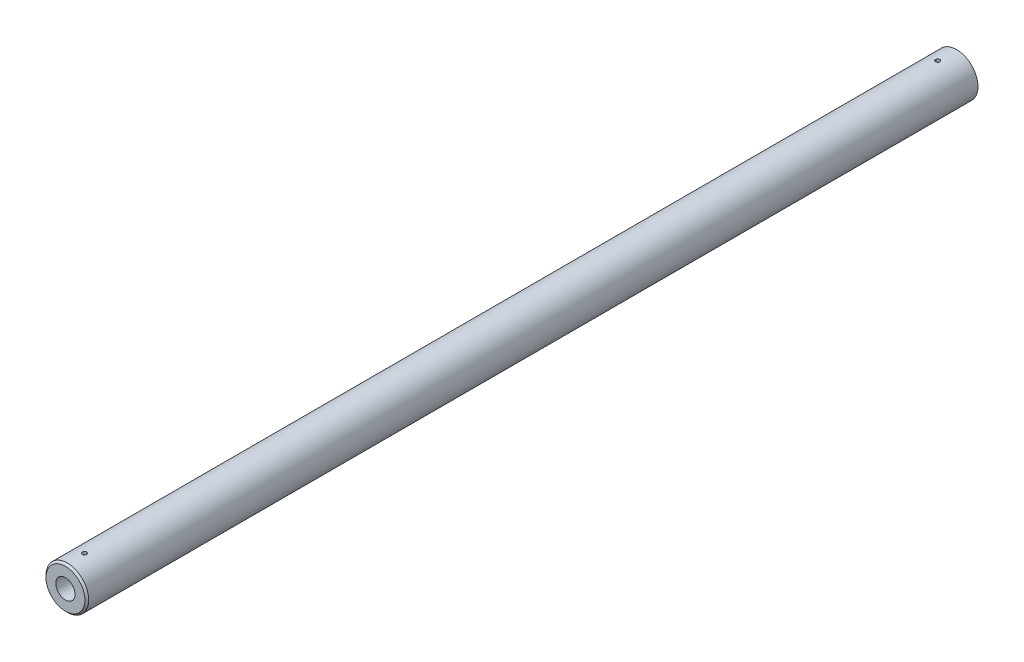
ISO-10303-21;
HEADER;
FILE_DESCRIPTION(('STEP AP214'),'2;1');
FILE_NAME('part.step','',(''),(''),'','','');
FILE_SCHEMA(('AUTOMOTIVE_DESIGN { 1 0 10303 214 1 1 1 1 }'));
ENDSEC;
DATA;
#1=APPLICATION_CONTEXT('core data for automotive mechanical design processes');
#2=APPLICATION_PROTOCOL_DEFINITION('international standard','automotive_design',2000,#1);
#3=PRODUCT_CONTEXT('',#1,'mechanical');
#4=PRODUCT('Part','Part','',(#3));
#5=PRODUCT_RELATED_PRODUCT_CATEGORY('part','',(#4));
#6=PRODUCT_DEFINITION_FORMATION('','',#4);
#7=PRODUCT_DEFINITION_CONTEXT('part definition',#1,'design');
#8=PRODUCT_DEFINITION('design','',#6,#7);
#9=PRODUCT_DEFINITION_SHAPE('','',#8);
#10=(LENGTH_UNIT() NAMED_UNIT(*) SI_UNIT(.MILLI.,.METRE.));
#11=(NAMED_UNIT(*) PLANE_ANGLE_UNIT() SI_UNIT($,.RADIAN.));
#12=(NAMED_UNIT(*) SI_UNIT($,.STERADIAN.) SOLID_ANGLE_UNIT());
#13=UNCERTAINTY_MEASURE_WITH_UNIT(LENGTH_MEASURE(1.E-05),#10,'distance_accuracy_value','');
#14=(GEOMETRIC_REPRESENTATION_CONTEXT(3) GLOBAL_UNCERTAINTY_ASSIGNED_CONTEXT((#13)) GLOBAL_UNIT_ASSIGNED_CONTEXT((#10,
#11,#12)) REPRESENTATION_CONTEXT('',''));
#15=CARTESIAN_POINT('',(0.,0.,0.));
#16=DIRECTION('',(0.,0.,1.));
#17=DIRECTION('',(1.,0.,0.));
#18=AXIS2_PLACEMENT_3D('',#15,#16,#17);
#19=CARTESIAN_POINT('',(0.,0.,0.));
#20=DIRECTION('',(0.,0.,1.));
#21=DIRECTION('',(1.,0.,0.));
#22=AXIS2_PLACEMENT_3D('',#19,#20,#21);
#23=CYLINDRICAL_SURFACE('',#22,22.5);
#24=CARTESIAN_POINT('',(0.,-22.5,-17.75));
#25=CARTESIAN_POINT('',(0.126045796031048,-22.4999985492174,-17.7500054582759));
#26=CARTESIAN_POINT('',(0.252174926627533,-22.4989295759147,-17.760627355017));
#27=CARTESIAN_POINT('',(0.500936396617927,-22.4947680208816,-17.8028398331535));
#28=CARTESIAN_POINT('',(0.623564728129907,-22.4916732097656,-17.8344535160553));
#29=CARTESIAN_POINT('',(0.861686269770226,-22.4838093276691,-17.9177200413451));
#30=CARTESIAN_POINT('',(0.977183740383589,-22.479041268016,-17.9693607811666));
#31=CARTESIAN_POINT('',(1.19784636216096,-22.4683640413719,-18.0911920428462));
#32=CARTESIAN_POINT('',(1.30301356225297,-22.462455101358,-18.1613788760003));
#33=CARTESIAN_POINT('',(1.50043398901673,-22.4501342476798,-18.3185810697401));
#34=CARTESIAN_POINT('',(1.59264482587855,-22.443720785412,-18.4056495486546));
#35=CARTESIAN_POINT('',(1.76117067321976,-22.4311265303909,-18.5940302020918));
#36=CARTESIAN_POINT('',(1.83748494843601,-22.4249457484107,-18.6953430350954));
#37=CARTESIAN_POINT('',(1.97220143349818,-22.4135008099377,-18.9096016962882));
#38=CARTESIAN_POINT('',(2.03056529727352,-22.4082386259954,-19.0225717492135));
#39=CARTESIAN_POINT('',(2.12747936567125,-22.3992458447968,-19.2567700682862));
#40=CARTESIAN_POINT('',(2.16603005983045,-22.3955152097,-19.3779981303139));
#41=CARTESIAN_POINT('',(2.22209784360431,-22.390021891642,-19.6248390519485));
#42=CARTESIAN_POINT('',(2.23968521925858,-22.3882526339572,-19.7504357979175));
#43=CARTESIAN_POINT('',(2.25354439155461,-22.3868619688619,-20.0028099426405));
#44=CARTESIAN_POINT('',(2.24981674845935,-22.3872405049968,-20.1295873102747));
#45=CARTESIAN_POINT('',(2.22120963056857,-22.3900966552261,-20.38023944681));
#46=CARTESIAN_POINT('',(2.19640689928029,-22.3925666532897,-20.5041230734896));
#47=CARTESIAN_POINT('',(2.12647307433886,-22.399315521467,-20.7459604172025));
#48=CARTESIAN_POINT('',(2.08134170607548,-22.4035944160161,-20.8639140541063));
#49=CARTESIAN_POINT('',(1.97194701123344,-22.4134877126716,-21.0907855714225));
#50=CARTESIAN_POINT('',(1.90764963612,-22.4191044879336,-21.199686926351));
#51=CARTESIAN_POINT('',(1.76177256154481,-22.4310386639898,-21.4051817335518));
#52=CARTESIAN_POINT('',(1.68019235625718,-22.4373560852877,-21.501774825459));
#53=CARTESIAN_POINT('',(1.5016367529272,-22.4500136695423,-21.6803571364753));
#54=CARTESIAN_POINT('',(1.40459507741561,-22.4563538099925,-21.7622801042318));
#55=CARTESIAN_POINT('',(1.19810133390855,-22.4683161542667,-21.9086831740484));
#56=CARTESIAN_POINT('',(1.08864925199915,-22.4739383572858,-21.9731632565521));
#57=CARTESIAN_POINT('',(0.860395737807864,-22.4838332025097,-22.0828475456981));
#58=CARTESIAN_POINT('',(0.741592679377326,-22.4881056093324,-22.1280483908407));
#59=CARTESIAN_POINT('',(0.498031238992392,-22.4948170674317,-22.1978425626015));
#60=CARTESIAN_POINT('',(0.373273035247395,-22.497256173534,-22.2224365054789));
#61=CARTESIAN_POINT('',(0.121916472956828,-22.500019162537,-22.2502346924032));
#62=CARTESIAN_POINT('',(-0.00467167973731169,-22.5003520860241,-22.2535303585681));
#63=CARTESIAN_POINT('',(-0.256598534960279,-22.498889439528,-22.2388785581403));
#64=CARTESIAN_POINT('',(-0.381937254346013,-22.4970938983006,-22.2209313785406));
#65=CARTESIAN_POINT('',(-0.627543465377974,-22.4915818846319,-22.1643791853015));
#66=CARTESIAN_POINT('',(-0.747820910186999,-22.4878693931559,-22.1258169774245));
#67=CARTESIAN_POINT('',(-0.980199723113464,-22.4789399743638,-22.0291733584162));
#68=CARTESIAN_POINT('',(-1.09230090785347,-22.4737230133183,-21.9710915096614));
#69=CARTESIAN_POINT('',(-1.30555840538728,-22.4623456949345,-21.8368306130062));
#70=CARTESIAN_POINT('',(-1.40667673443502,-22.4561822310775,-21.7605914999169));
#71=CARTESIAN_POINT('',(-1.59471365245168,-22.4436134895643,-21.5922663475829));
#72=CARTESIAN_POINT('',(-1.6816318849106,-22.4372082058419,-21.5001799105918));
#73=CARTESIAN_POINT('',(-1.83911874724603,-22.424850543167,-21.3023752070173));
#74=CARTESIAN_POINT('',(-1.90962737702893,-22.418899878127,-21.1966090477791));
#75=CARTESIAN_POINT('',(-2.03188108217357,-22.4081512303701,-20.97468343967));
#76=CARTESIAN_POINT('',(-2.08362641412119,-22.4033532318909,-20.8585241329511));
#77=CARTESIAN_POINT('',(-2.16678421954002,-22.3954638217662,-20.619315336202));
#78=CARTESIAN_POINT('',(-2.19823239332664,-22.3923694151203,-20.496278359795));
#79=CARTESIAN_POINT('',(-2.24001901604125,-22.3882282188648,-20.2466378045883));
#80=CARTESIAN_POINT('',(-2.25035807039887,-22.3871813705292,-20.1200343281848));
#81=CARTESIAN_POINT('',(-2.24962456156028,-22.3872550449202,-19.8674509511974));
#82=CARTESIAN_POINT('',(-2.23864625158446,-22.3883660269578,-19.7414707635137));
#83=CARTESIAN_POINT('',(-2.19578726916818,-22.3926098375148,-19.4931539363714));
#84=CARTESIAN_POINT('',(-2.16390657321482,-22.3957426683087,-19.3708173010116));
#85=CARTESIAN_POINT('',(-2.08017379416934,-22.4036745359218,-19.1332609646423));
#86=CARTESIAN_POINT('',(-2.02832447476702,-22.4084733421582,-19.0180402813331));
#87=CARTESIAN_POINT('',(-1.90613599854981,-22.4191969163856,-18.7979219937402));
#88=CARTESIAN_POINT('',(-1.83579694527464,-22.4251216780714,-18.6930243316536));
#89=CARTESIAN_POINT('',(-1.67827175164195,-22.4374609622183,-18.4960467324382));
#90=CARTESIAN_POINT('',(-1.59101538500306,-22.4438774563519,-18.4040230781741));
#91=CARTESIAN_POINT('',(-1.40227132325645,-22.4564592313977,-18.2358824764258));
#92=CARTESIAN_POINT('',(-1.30078022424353,-22.462624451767,-18.1597693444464));
#93=CARTESIAN_POINT('',(-1.08616822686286,-22.4740251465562,-18.0254597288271));
#94=CARTESIAN_POINT('',(-0.973018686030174,-22.4792582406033,-17.9673088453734));
#95=CARTESIAN_POINT('',(-0.738581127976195,-22.4881791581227,-17.8709095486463));
#96=CARTESIAN_POINT('',(-0.617302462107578,-22.4918687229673,-17.8326386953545));
#97=CARTESIAN_POINT('',(-0.412781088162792,-22.4963598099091,-17.7866286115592));
#98=CARTESIAN_POINT('',(-0.330845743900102,-22.4977185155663,-17.7729116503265));
#99=CARTESIAN_POINT('',(-0.165952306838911,-22.4995390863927,-17.7545955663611));
#100=CARTESIAN_POINT('',(-0.0829942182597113,-22.5000009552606,-17.7499964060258));
#101=CARTESIAN_POINT('',(0.,-22.5,-17.75));
#102=B_SPLINE_CURVE_WITH_KNOTS('',3,(#24,#25,#26,#27,#28,#29,#30,#31,#32,#33,#34,#35,#36,#37,
#38,#39,#40,#41,#42,#43,#44,#45,#46,#47,#48,#49,#50,#51,#52,#53,#54,#55,#56,#57,#58,#59,#60,#61,
#62,#63,#64,#65,#66,#67,#68,#69,#70,#71,#72,#73,#74,#75,#76,#77,#78,#79,#80,#81,#82,#83,#84,#85,
#86,#87,#88,#89,#90,#91,#92,#93,#94,#95,#96,#97,#98,#99,#100,#101),.UNSPECIFIED.,.T.,.F.,(4,2,2,
2,2,2,2,2,2,2,2,2,2,2,2,2,2,2,2,2,2,2,2,2,2,2,2,2,2,2,2,2,2,2,2,2,2,2,4),(0.,0.377834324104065,
0.756085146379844,1.13410774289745,1.51205520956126,1.89121177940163,2.27038588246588,
2.65036444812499,3.03033362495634,3.40902522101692,3.78770686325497,4.16501544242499,
4.54232911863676,4.92031713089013,5.29831620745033,5.67798151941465,6.05764725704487,
6.43737916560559,6.81709971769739,7.19518924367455,7.57327366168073,7.95057604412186,
8.32788688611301,8.70646366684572,9.08504995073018,9.46499948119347,9.84494381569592,
10.2242180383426,10.6034813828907,10.981071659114,11.3586623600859,11.736200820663,
12.1137371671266,12.4928756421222,12.8721049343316,13.2522891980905,13.6320433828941,
13.8808275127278,14.1296106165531),.UNSPECIFIED.);
#103=CARTESIAN_POINT('',(0.,-22.5,-17.75));
#104=VERTEX_POINT('',#103);
#105=EDGE_CURVE('E58',#104,#104,#102,.T.);
#106=ORIENTED_EDGE('',*,*,#105,.T.);
#107=EDGE_LOOP('',(#106));
#108=FACE_BOUND('',#107,.T.);
#109=CARTESIAN_POINT('',(0.,22.5,-17.75));
#110=CARTESIAN_POINT('',(-0.126045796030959,22.4999985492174,-17.7500054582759));
#111=CARTESIAN_POINT('',(-0.252174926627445,22.4989295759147,-17.760627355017));
#112=CARTESIAN_POINT('',(-0.500936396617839,22.4947680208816,-17.8028398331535));
#113=CARTESIAN_POINT('',(-0.623564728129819,22.4916732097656,-17.8344535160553));
#114=CARTESIAN_POINT('',(-0.861686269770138,22.4838093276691,-17.9177200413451));
#115=CARTESIAN_POINT('',(-0.977183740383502,22.479041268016,-17.9693607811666));
#116=CARTESIAN_POINT('',(-1.19784636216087,22.4683640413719,-18.0911920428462));
#117=CARTESIAN_POINT('',(-1.30301356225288,22.462455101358,-18.1613788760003));
#118=CARTESIAN_POINT('',(-1.50043398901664,22.4501342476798,-18.3185810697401));
#119=CARTESIAN_POINT('',(-1.59264482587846,22.443720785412,-18.4056495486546));
#120=CARTESIAN_POINT('',(-1.76117067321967,22.431126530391,-18.5940302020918));
#121=CARTESIAN_POINT('',(-1.83748494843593,22.4249457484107,-18.6953430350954));
#122=CARTESIAN_POINT('',(-1.9722014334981,22.4135008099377,-18.9096016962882));
#123=CARTESIAN_POINT('',(-2.03056529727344,22.4082386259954,-19.0225717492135));
#124=CARTESIAN_POINT('',(-2.12747936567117,22.3992458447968,-19.2567700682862));
#125=CARTESIAN_POINT('',(-2.16603005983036,22.3955152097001,-19.3779981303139));
#126=CARTESIAN_POINT('',(-2.22209784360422,22.390021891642,-19.6248390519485));
#127=CARTESIAN_POINT('',(-2.2396852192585,22.3882526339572,-19.7504357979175));
#128=CARTESIAN_POINT('',(-2.25354439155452,22.3868619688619,-20.0028099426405));
#129=CARTESIAN_POINT('',(-2.24981674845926,22.3872405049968,-20.1295873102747));
#130=CARTESIAN_POINT('',(-2.22120963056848,22.3900966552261,-20.38023944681));
#131=CARTESIAN_POINT('',(-2.1964068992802,22.3925666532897,-20.5041230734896));
#132=CARTESIAN_POINT('',(-2.12647307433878,22.399315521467,-20.7459604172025));
#133=CARTESIAN_POINT('',(-2.08134170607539,22.4035944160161,-20.8639140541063));
#134=CARTESIAN_POINT('',(-1.97194701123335,22.4134877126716,-21.0907855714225));
#135=CARTESIAN_POINT('',(-1.90764963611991,22.4191044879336,-21.199686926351));
#136=CARTESIAN_POINT('',(-1.76177256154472,22.4310386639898,-21.4051817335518));
#137=CARTESIAN_POINT('',(-1.6801923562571,22.4373560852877,-21.501774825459));
#138=CARTESIAN_POINT('',(-1.50163675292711,22.4500136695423,-21.6803571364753));
#139=CARTESIAN_POINT('',(-1.40459507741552,22.4563538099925,-21.7622801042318));
#140=CARTESIAN_POINT('',(-1.19810133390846,22.4683161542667,-21.9086831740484));
#141=CARTESIAN_POINT('',(-1.08864925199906,22.4739383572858,-21.9731632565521));
#142=CARTESIAN_POINT('',(-0.860395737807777,22.4838332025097,-22.0828475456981));
#143=CARTESIAN_POINT('',(-0.741592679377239,22.4881056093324,-22.1280483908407));
#144=CARTESIAN_POINT('',(-0.498031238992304,22.4948170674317,-22.1978425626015));
#145=CARTESIAN_POINT('',(-0.373273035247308,22.497256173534,-22.2224365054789));
#146=CARTESIAN_POINT('',(-0.121916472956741,22.500019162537,-22.2502346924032));
#147=CARTESIAN_POINT('',(0.00467167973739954,22.5003520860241,-22.2535303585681));
#148=CARTESIAN_POINT('',(0.256598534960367,22.498889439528,-22.2388785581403));
#149=CARTESIAN_POINT('',(0.3819372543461,22.4970938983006,-22.2209313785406));
#150=CARTESIAN_POINT('',(0.627543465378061,22.4915818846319,-22.1643791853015));
#151=CARTESIAN_POINT('',(0.747820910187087,22.4878693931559,-22.1258169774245));
#152=CARTESIAN_POINT('',(0.980199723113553,22.4789399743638,-22.0291733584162));
#153=CARTESIAN_POINT('',(1.09230090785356,22.4737230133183,-21.9710915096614));
#154=CARTESIAN_POINT('',(1.30555840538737,22.4623456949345,-21.8368306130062));
#155=CARTESIAN_POINT('',(1.40667673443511,22.4561822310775,-21.7605914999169));
#156=CARTESIAN_POINT('',(1.59471365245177,22.4436134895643,-21.5922663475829));
#157=CARTESIAN_POINT('',(1.68163188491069,22.4372082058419,-21.5001799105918));
#158=CARTESIAN_POINT('',(1.83911874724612,22.424850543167,-21.3023752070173));
#159=CARTESIAN_POINT('',(1.90962737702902,22.418899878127,-21.1966090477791));
#160=CARTESIAN_POINT('',(2.03188108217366,22.4081512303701,-20.97468343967));
#161=CARTESIAN_POINT('',(2.08362641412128,22.4033532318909,-20.8585241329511));
#162=CARTESIAN_POINT('',(2.16678421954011,22.3954638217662,-20.619315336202));
#163=CARTESIAN_POINT('',(2.19823239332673,22.3923694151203,-20.496278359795));
#164=CARTESIAN_POINT('',(2.24001901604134,22.3882282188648,-20.2466378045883));
#165=CARTESIAN_POINT('',(2.25035807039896,22.3871813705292,-20.1200343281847));
#166=CARTESIAN_POINT('',(2.24962456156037,22.3872550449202,-19.8674509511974));
#167=CARTESIAN_POINT('',(2.23864625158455,22.3883660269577,-19.7414707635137));
#168=CARTESIAN_POINT('',(2.19578726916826,22.3926098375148,-19.4931539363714));
#169=CARTESIAN_POINT('',(2.1639065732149,22.3957426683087,-19.3708173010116));
#170=CARTESIAN_POINT('',(2.08017379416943,22.4036745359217,-19.1332609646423));
#171=CARTESIAN_POINT('',(2.02832447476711,22.4084733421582,-19.0180402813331));
#172=CARTESIAN_POINT('',(1.9061359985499,22.4191969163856,-18.7979219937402));
#173=CARTESIAN_POINT('',(1.83579694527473,22.4251216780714,-18.6930243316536));
#174=CARTESIAN_POINT('',(1.67827175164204,22.4374609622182,-18.4960467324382));
#175=CARTESIAN_POINT('',(1.59101538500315,22.4438774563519,-18.4040230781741));
#176=CARTESIAN_POINT('',(1.40227132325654,22.4564592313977,-18.2358824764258));
#177=CARTESIAN_POINT('',(1.30078022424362,22.462624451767,-18.1597693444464));
#178=CARTESIAN_POINT('',(1.08616822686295,22.4740251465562,-18.0254597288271));
#179=CARTESIAN_POINT('',(0.973018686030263,22.4792582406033,-17.9673088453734));
#180=CARTESIAN_POINT('',(0.738581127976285,22.4881791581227,-17.8709095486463));
#181=CARTESIAN_POINT('',(0.617302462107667,22.4918687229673,-17.8326386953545));
#182=CARTESIAN_POINT('',(0.412781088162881,22.4963598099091,-17.7866286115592));
#183=CARTESIAN_POINT('',(0.330845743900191,22.4977185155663,-17.7729116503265));
#184=CARTESIAN_POINT('',(0.165952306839,22.4995390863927,-17.7545955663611));
#185=CARTESIAN_POINT('',(0.0829942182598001,22.5000009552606,-17.7499964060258));
#186=CARTESIAN_POINT('',(0.,22.5,-17.75));
#187=B_SPLINE_CURVE_WITH_KNOTS('',3,(#109,#110,#111,#112,#113,#114,#115,#116,#117,#118,#119,
#120,#121,#122,#123,#124,#125,#126,#127,#128,#129,#130,#131,#132,#133,#134,#135,#136,#137,#138,
#139,#140,#141,#142,#143,#144,#145,#146,#147,#148,#149,#150,#151,#152,#153,#154,#155,#156,#157,
#158,#159,#160,#161,#162,#163,#164,#165,#166,#167,#168,#169,#170,#171,#172,#173,#174,#175,#176,
#177,#178,#179,#180,#181,#182,#183,#184,#185,#186),.UNSPECIFIED.,.T.,.F.,(4,2,2,2,2,2,2,2,2,2,2,
2,2,2,2,2,2,2,2,2,2,2,2,2,2,2,2,2,2,2,2,2,2,2,2,2,2,2,4),(0.,0.377834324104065,
0.756085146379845,1.13410774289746,1.51205520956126,1.89121177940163,2.27038588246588,
2.65036444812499,3.03033362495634,3.40902522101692,3.78770686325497,4.16501544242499,
4.54232911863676,4.92031713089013,5.29831620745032,5.67798151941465,6.05764725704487,
6.43737916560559,6.81709971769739,7.19518924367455,7.57327366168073,7.95057604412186,
8.32788688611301,8.70646366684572,9.08504995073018,9.46499948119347,9.84494381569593,
10.2242180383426,10.6034813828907,10.981071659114,11.3586623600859,11.736200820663,
12.1137371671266,12.4928756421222,12.8721049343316,13.2522891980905,13.6320433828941,
13.8808275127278,14.1296106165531),.UNSPECIFIED.);
#188=CARTESIAN_POINT('',(0.,22.5,-17.75));
#189=VERTEX_POINT('',#188);
#190=EDGE_CURVE('E152',#189,#189,#187,.T.);
#191=ORIENTED_EDGE('',*,*,#190,.T.);
#192=EDGE_LOOP('',(#191));
#193=FACE_BOUND('',#192,.T.);
#194=CARTESIAN_POINT('',(0.,-22.5,-915.75));
#195=CARTESIAN_POINT('',(0.126045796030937,-22.4999985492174,-915.750005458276));
#196=CARTESIAN_POINT('',(0.252174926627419,-22.4989295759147,-915.760627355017));
#197=CARTESIAN_POINT('',(0.500936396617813,-22.4947680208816,-915.802839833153));
#198=CARTESIAN_POINT('',(0.623564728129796,-22.4916732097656,-915.834453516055));
#199=CARTESIAN_POINT('',(0.861686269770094,-22.4838093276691,-915.917720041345));
#200=CARTESIAN_POINT('',(0.977183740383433,-22.479041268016,-915.969360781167));
#201=CARTESIAN_POINT('',(1.19784636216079,-22.4683640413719,-916.091192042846));
#202=CARTESIAN_POINT('',(1.30301356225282,-22.462455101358,-916.161378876));
#203=CARTESIAN_POINT('',(1.50043398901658,-22.4501342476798,-916.31858106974));
#204=CARTESIAN_POINT('',(1.59264482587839,-22.443720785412,-916.405649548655));
#205=CARTESIAN_POINT('',(1.76117067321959,-22.431126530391,-916.594030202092));
#206=CARTESIAN_POINT('',(1.83748494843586,-22.4249457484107,-916.695343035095));
#207=CARTESIAN_POINT('',(1.97220143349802,-22.4135008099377,-916.909601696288));
#208=CARTESIAN_POINT('',(2.03056529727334,-22.4082386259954,-917.022571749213));
#209=CARTESIAN_POINT('',(2.12747936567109,-22.3992458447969,-917.256770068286));
#210=CARTESIAN_POINT('',(2.16603005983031,-22.3955152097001,-917.377998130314));
#211=CARTESIAN_POINT('',(2.22209784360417,-22.390021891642,-917.624839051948));
#212=CARTESIAN_POINT('',(2.23968521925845,-22.3882526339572,-917.750435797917));
#213=CARTESIAN_POINT('',(2.25354439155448,-22.3868619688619,-918.00280994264));
#214=CARTESIAN_POINT('',(2.24981674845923,-22.3872405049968,-918.129587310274));
#215=CARTESIAN_POINT('',(2.22120963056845,-22.3900966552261,-918.38023944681));
#216=CARTESIAN_POINT('',(2.19640689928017,-22.3925666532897,-918.504123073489));
#217=CARTESIAN_POINT('',(2.12647307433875,-22.399315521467,-918.745960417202));
#218=CARTESIAN_POINT('',(2.08134170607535,-22.4035944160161,-918.863914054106));
#219=CARTESIAN_POINT('',(1.97194701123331,-22.4134877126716,-919.090785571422));
#220=CARTESIAN_POINT('',(1.90764963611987,-22.4191044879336,-919.199686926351));
#221=CARTESIAN_POINT('',(1.76177256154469,-22.4310386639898,-919.405181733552));
#222=CARTESIAN_POINT('',(1.68019235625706,-22.4373560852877,-919.501774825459));
#223=CARTESIAN_POINT('',(1.50163675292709,-22.4500136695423,-919.680357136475));
#224=CARTESIAN_POINT('',(1.40459507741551,-22.4563538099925,-919.762280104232));
#225=CARTESIAN_POINT('',(1.19810133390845,-22.4683161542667,-919.908683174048));
#226=CARTESIAN_POINT('',(1.08864925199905,-22.4739383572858,-919.973163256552));
#227=CARTESIAN_POINT('',(0.860395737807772,-22.4838332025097,-920.082847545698));
#228=CARTESIAN_POINT('',(0.741592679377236,-22.4881056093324,-920.128048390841));
#229=CARTESIAN_POINT('',(0.498031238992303,-22.4948170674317,-920.197842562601));
#230=CARTESIAN_POINT('',(0.373273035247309,-22.497256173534,-920.222436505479));
#231=CARTESIAN_POINT('',(0.121916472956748,-22.500019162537,-920.250234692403));
#232=CARTESIAN_POINT('',(-0.00467167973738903,-22.5003520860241,-920.253530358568));
#233=CARTESIAN_POINT('',(-0.256598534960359,-22.498889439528,-920.23887855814));
#234=CARTESIAN_POINT('',(-0.381937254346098,-22.4970938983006,-920.220931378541));
#235=CARTESIAN_POINT('',(-0.627543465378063,-22.4915818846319,-920.164379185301));
#236=CARTESIAN_POINT('',(-0.747820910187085,-22.4878693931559,-920.125816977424));
#237=CARTESIAN_POINT('',(-0.980199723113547,-22.4789399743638,-920.029173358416));
#238=CARTESIAN_POINT('',(-1.09230090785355,-22.4737230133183,-919.971091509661));
#239=CARTESIAN_POINT('',(-1.30555840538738,-22.4623456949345,-919.836830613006));
#240=CARTESIAN_POINT('',(-1.40667673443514,-22.4561822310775,-919.760591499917));
#241=CARTESIAN_POINT('',(-1.59471365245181,-22.4436134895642,-919.592266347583));
#242=CARTESIAN_POINT('',(-1.68163188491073,-22.4372082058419,-919.500179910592));
#243=CARTESIAN_POINT('',(-1.83911874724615,-22.424850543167,-919.302375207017));
#244=CARTESIAN_POINT('',(-1.90962737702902,-22.418899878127,-919.196609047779));
#245=CARTESIAN_POINT('',(-2.03188108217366,-22.4081512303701,-918.97468343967));
#246=CARTESIAN_POINT('',(-2.08362641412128,-22.4033532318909,-918.858524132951));
#247=CARTESIAN_POINT('',(-2.16678421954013,-22.3954638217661,-918.619315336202));
#248=CARTESIAN_POINT('',(-2.19823239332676,-22.3923694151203,-918.496278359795));
#249=CARTESIAN_POINT('',(-2.24001901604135,-22.3882282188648,-918.246637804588));
#250=CARTESIAN_POINT('',(-2.25035807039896,-22.3871813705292,-918.120034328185));
#251=CARTESIAN_POINT('',(-2.24962456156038,-22.3872550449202,-917.867450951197));
#252=CARTESIAN_POINT('',(-2.23864625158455,-22.3883660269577,-917.741470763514));
#253=CARTESIAN_POINT('',(-2.19578726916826,-22.3926098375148,-917.493153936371));
#254=CARTESIAN_POINT('',(-2.1639065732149,-22.3957426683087,-917.370817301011));
#255=CARTESIAN_POINT('',(-2.0801737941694,-22.4036745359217,-917.133260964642));
#256=CARTESIAN_POINT('',(-2.02832447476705,-22.4084733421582,-917.018040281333));
#257=CARTESIAN_POINT('',(-1.90613599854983,-22.4191969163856,-916.79792199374));
#258=CARTESIAN_POINT('',(-1.83579694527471,-22.4251216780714,-916.693024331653));
#259=CARTESIAN_POINT('',(-1.67827175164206,-22.4374609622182,-916.496046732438));
#260=CARTESIAN_POINT('',(-1.59101538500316,-22.4438774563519,-916.404023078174));
#261=CARTESIAN_POINT('',(-1.40227132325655,-22.4564592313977,-916.235882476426));
#262=CARTESIAN_POINT('',(-1.30078022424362,-22.462624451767,-916.159769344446));
#263=CARTESIAN_POINT('',(-1.08616822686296,-22.4740251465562,-916.025459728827));
#264=CARTESIAN_POINT('',(-0.973018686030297,-22.4792582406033,-915.967308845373));
#265=CARTESIAN_POINT('',(-0.738581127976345,-22.4881791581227,-915.870909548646));
#266=CARTESIAN_POINT('',(-0.617302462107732,-22.4918687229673,-915.832638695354));
#267=CARTESIAN_POINT('',(-0.412781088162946,-22.4963598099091,-915.786628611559));
#268=CARTESIAN_POINT('',(-0.330845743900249,-22.4977185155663,-915.772911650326));
#269=CARTESIAN_POINT('',(-0.16595230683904,-22.4995390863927,-915.754595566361));
#270=CARTESIAN_POINT('',(-0.0829942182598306,-22.5000009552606,-915.749996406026));
#271=CARTESIAN_POINT('',(0.,-22.5,-915.75));
#272=B_SPLINE_CURVE_WITH_KNOTS('',3,(#194,#195,#196,#197,#198,#199,#200,#201,#202,#203,#204,
#205,#206,#207,#208,#209,#210,#211,#212,#213,#214,#215,#216,#217,#218,#219,#220,#221,#222,#223,
#224,#225,#226,#227,#228,#229,#230,#231,#232,#233,#234,#235,#236,#237,#238,#239,#240,#241,#242,
#243,#244,#245,#246,#247,#248,#249,#250,#251,#252,#253,#254,#255,#256,#257,#258,#259,#260,#261,
#262,#263,#264,#265,#266,#267,#268,#269,#270,#271),.UNSPECIFIED.,.T.,.F.,(4,2,2,2,2,2,2,2,2,2,2,
2,2,2,2,2,2,2,2,2,2,2,2,2,2,2,2,2,2,2,2,2,2,2,2,2,2,2,4),(0.,0.377834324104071,
0.756085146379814,1.13410774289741,1.51205520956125,1.89121177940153,2.27038588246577,
2.65036444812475,3.03033362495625,3.40902522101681,3.78770686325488,4.1650154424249,
4.54232911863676,4.92031713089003,5.29831620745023,5.67798151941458,6.05764725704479,
6.43737916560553,6.8170997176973,7.19518924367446,7.57327366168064,7.95057604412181,
8.32788688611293,8.70646366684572,9.08504995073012,9.46499948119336,9.84494381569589,
10.2242180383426,10.6034813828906,10.9810716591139,11.3586623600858,11.7362008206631,
12.1137371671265,12.4928756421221,12.8721049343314,13.2522891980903,13.632043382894,
13.8808275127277,14.129610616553),.UNSPECIFIED.);
#273=CARTESIAN_POINT('',(0.,-22.5,-915.75));
#274=VERTEX_POINT('',#273);
#275=EDGE_CURVE('E84',#274,#274,#272,.T.);
#276=ORIENTED_EDGE('',*,*,#275,.T.);
#277=EDGE_LOOP('',(#276));
#278=FACE_BOUND('',#277,.T.);
#279=CARTESIAN_POINT('',(0.,22.5,-915.75));
#280=CARTESIAN_POINT('',(-0.126045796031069,22.4999985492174,-915.750005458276));
#281=CARTESIAN_POINT('',(-0.252174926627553,22.4989295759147,-915.760627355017));
#282=CARTESIAN_POINT('',(-0.500936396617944,22.4947680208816,-915.802839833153));
#283=CARTESIAN_POINT('',(-0.623564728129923,22.4916732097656,-915.834453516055));
#284=CARTESIAN_POINT('',(-0.861686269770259,22.4838093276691,-915.917720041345));
#285=CARTESIAN_POINT('',(-0.977183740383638,22.479041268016,-915.969360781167));
#286=CARTESIAN_POINT('',(-1.19784636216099,22.4683640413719,-916.091192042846));
#287=CARTESIAN_POINT('',(-1.30301356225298,22.462455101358,-916.161378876));
#288=CARTESIAN_POINT('',(-1.5004339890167,22.4501342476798,-916.31858106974));
#289=CARTESIAN_POINT('',(-1.59264482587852,22.443720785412,-916.405649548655));
#290=CARTESIAN_POINT('',(-1.76117067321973,22.4311265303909,-916.594030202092));
#291=CARTESIAN_POINT('',(-1.83748494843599,22.4249457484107,-916.695343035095));
#292=CARTESIAN_POINT('',(-1.97220143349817,22.4135008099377,-916.909601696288));
#293=CARTESIAN_POINT('',(-2.0305652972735,22.4082386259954,-917.022571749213));
#294=CARTESIAN_POINT('',(-2.12747936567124,22.3992458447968,-917.256770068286));
#295=CARTESIAN_POINT('',(-2.16603005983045,22.3955152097,-917.377998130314));
#296=CARTESIAN_POINT('',(-2.22209784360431,22.390021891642,-917.624839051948));
#297=CARTESIAN_POINT('',(-2.23968521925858,22.3882526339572,-917.750435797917));
#298=CARTESIAN_POINT('',(-2.25354439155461,22.3868619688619,-918.00280994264));
#299=CARTESIAN_POINT('',(-2.24981674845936,22.3872405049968,-918.129587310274));
#300=CARTESIAN_POINT('',(-2.22120963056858,22.3900966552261,-918.38023944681));
#301=CARTESIAN_POINT('',(-2.1964068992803,22.3925666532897,-918.504123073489));
#302=CARTESIAN_POINT('',(-2.12647307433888,22.399315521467,-918.745960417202));
#303=CARTESIAN_POINT('',(-2.08134170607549,22.4035944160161,-918.863914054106));
#304=CARTESIAN_POINT('',(-1.97194701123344,22.4134877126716,-919.090785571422));
#305=CARTESIAN_POINT('',(-1.90764963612,22.4191044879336,-919.199686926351));
#306=CARTESIAN_POINT('',(-1.76177256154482,22.4310386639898,-919.405181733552));
#307=CARTESIAN_POINT('',(-1.6801923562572,22.4373560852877,-919.501774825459));
#308=CARTESIAN_POINT('',(-1.50163675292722,22.4500136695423,-919.680357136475));
#309=CARTESIAN_POINT('',(-1.40459507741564,22.4563538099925,-919.762280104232));
#310=CARTESIAN_POINT('',(-1.19810133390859,22.4683161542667,-919.908683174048));
#311=CARTESIAN_POINT('',(-1.08864925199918,22.4739383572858,-919.973163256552));
#312=CARTESIAN_POINT('',(-0.860395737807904,22.4838332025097,-920.082847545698));
#313=CARTESIAN_POINT('',(-0.741592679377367,22.4881056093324,-920.128048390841));
#314=CARTESIAN_POINT('',(-0.498031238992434,22.4948170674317,-920.197842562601));
#315=CARTESIAN_POINT('',(-0.37327303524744,22.497256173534,-920.222436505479));
#316=CARTESIAN_POINT('',(-0.121916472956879,22.500019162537,-920.250234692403));
#317=CARTESIAN_POINT('',(0.00467167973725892,22.5003520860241,-920.253530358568));
#318=CARTESIAN_POINT('',(0.256598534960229,22.498889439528,-920.23887855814));
#319=CARTESIAN_POINT('',(0.381937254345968,22.4970938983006,-920.220931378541));
#320=CARTESIAN_POINT('',(0.627543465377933,22.4915818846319,-920.164379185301));
#321=CARTESIAN_POINT('',(0.747820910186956,22.4878693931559,-920.125816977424));
#322=CARTESIAN_POINT('',(0.980199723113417,22.4789399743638,-920.029173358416));
#323=CARTESIAN_POINT('',(1.09230090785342,22.4737230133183,-919.971091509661));
#324=CARTESIAN_POINT('',(1.30555840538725,22.4623456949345,-919.836830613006));
#325=CARTESIAN_POINT('',(1.40667673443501,22.4561822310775,-919.760591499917));
#326=CARTESIAN_POINT('',(1.59471365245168,22.4436134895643,-919.592266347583));
#327=CARTESIAN_POINT('',(1.6816318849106,22.4372082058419,-919.500179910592));
#328=CARTESIAN_POINT('',(1.83911874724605,22.424850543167,-919.302375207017));
#329=CARTESIAN_POINT('',(1.90962737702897,22.418899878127,-919.196609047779));
#330=CARTESIAN_POINT('',(2.03188108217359,22.4081512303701,-918.97468343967));
#331=CARTESIAN_POINT('',(2.08362641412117,22.4033532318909,-918.858524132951));
#332=CARTESIAN_POINT('',(2.16678421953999,22.3954638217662,-918.619315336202));
#333=CARTESIAN_POINT('',(2.19823239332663,22.3923694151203,-918.496278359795));
#334=CARTESIAN_POINT('',(2.24001901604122,22.3882282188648,-918.246637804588));
#335=CARTESIAN_POINT('',(2.25035807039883,22.3871813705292,-918.120034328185));
#336=CARTESIAN_POINT('',(2.24962456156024,22.3872550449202,-917.867450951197));
#337=CARTESIAN_POINT('',(2.23864625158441,22.3883660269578,-917.741470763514));
#338=CARTESIAN_POINT('',(2.19578726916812,22.3926098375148,-917.493153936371));
#339=CARTESIAN_POINT('',(2.16390657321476,22.3957426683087,-917.370817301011));
#340=CARTESIAN_POINT('',(2.08017379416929,22.4036745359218,-917.133260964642));
#341=CARTESIAN_POINT('',(2.02832447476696,22.4084733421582,-917.018040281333));
#342=CARTESIAN_POINT('',(1.90613599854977,22.4191969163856,-916.79792199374));
#343=CARTESIAN_POINT('',(1.83579694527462,22.4251216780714,-916.693024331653));
#344=CARTESIAN_POINT('',(1.67827175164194,22.4374609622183,-916.496046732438));
#345=CARTESIAN_POINT('',(1.59101538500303,22.4438774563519,-916.404023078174));
#346=CARTESIAN_POINT('',(1.40227132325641,22.4564592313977,-916.235882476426));
#347=CARTESIAN_POINT('',(1.30078022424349,22.462624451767,-916.159769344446));
#348=CARTESIAN_POINT('',(1.08616822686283,22.4740251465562,-916.025459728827));
#349=CARTESIAN_POINT('',(0.973018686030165,22.4792582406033,-915.967308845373));
#350=CARTESIAN_POINT('',(0.738581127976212,22.4881791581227,-915.870909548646));
#351=CARTESIAN_POINT('',(0.6173024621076,22.4918687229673,-915.832638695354));
#352=CARTESIAN_POINT('',(0.412781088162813,22.4963598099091,-915.786628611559));
#353=CARTESIAN_POINT('',(0.330845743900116,22.4977185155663,-915.772911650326));
#354=CARTESIAN_POINT('',(0.165952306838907,22.4995390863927,-915.754595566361));
#355=CARTESIAN_POINT('',(0.0829942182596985,22.5000009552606,-915.749996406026));
#356=CARTESIAN_POINT('',(0.,22.5,-915.75));
#357=B_SPLINE_CURVE_WITH_KNOTS('',3,(#279,#280,#281,#282,#283,#284,#285,#286,#287,#288,#289,
#290,#291,#292,#293,#294,#295,#296,#297,#298,#299,#300,#301,#302,#303,#304,#305,#306,#307,#308,
#309,#310,#311,#312,#313,#314,#315,#316,#317,#318,#319,#320,#321,#322,#323,#324,#325,#326,#327,
#328,#329,#330,#331,#332,#333,#334,#335,#336,#337,#338,#339,#340,#341,#342,#343,#344,#345,#346,
#347,#348,#349,#350,#351,#352,#353,#354,#355,#356),.UNSPECIFIED.,.T.,.F.,(4,2,2,2,2,2,2,2,2,2,2,
2,2,2,2,2,2,2,2,2,2,2,2,2,2,2,2,2,2,2,2,2,2,2,2,2,2,2,4),(0.,0.377834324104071,
0.756085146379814,1.13410774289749,1.51205520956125,1.89121177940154,2.27038588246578,
2.65036444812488,3.03033362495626,3.40902522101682,3.78770686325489,4.16501544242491,
4.54232911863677,4.92031713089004,5.29831620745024,5.67798151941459,6.0576472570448,
6.43737916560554,6.81709971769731,7.19518924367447,7.57327366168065,7.95057604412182,
8.32788688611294,8.70646366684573,9.08504995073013,9.46499948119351,9.84494381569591,
10.2242180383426,10.6034813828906,10.9810716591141,11.3586623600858,11.7362008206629,
12.1137371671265,12.4928756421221,12.8721049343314,13.2522891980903,13.632043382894,
13.8808275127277,14.129610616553),.UNSPECIFIED.);
#358=CARTESIAN_POINT('',(0.,22.5,-915.75));
#359=VERTEX_POINT('',#358);
#360=EDGE_CURVE('E79',#359,#359,#357,.T.);
#361=ORIENTED_EDGE('',*,*,#360,.T.);
#362=EDGE_LOOP('',(#361));
#363=FACE_BOUND('',#362,.T.);
#364=CARTESIAN_POINT('',(0.,0.,-2.));
#365=DIRECTION('',(0.,0.,1.));
#366=DIRECTION('',(1.,0.,0.));
#367=AXIS2_PLACEMENT_3D('',#364,#365,#366);
#368=CIRCLE('',#367,22.4999999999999);
#369=CARTESIAN_POINT('',(22.4999999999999,0.,-2.));
#370=VERTEX_POINT('',#369);
#371=EDGE_CURVE('E10',#370,#370,#368,.T.);
#372=ORIENTED_EDGE('',*,*,#371,.F.);
#373=EDGE_LOOP('',(#372));
#374=FACE_BOUND('',#373,.T.);
#375=CARTESIAN_POINT('',(0.,0.,-938.));
#376=DIRECTION('',(0.,0.,1.));
#377=DIRECTION('',(1.,0.,0.));
#378=AXIS2_PLACEMENT_3D('',#375,#376,#377);
#379=CIRCLE('',#378,22.5000000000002);
#380=CARTESIAN_POINT('',(22.5000000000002,0.,-938.));
#381=VERTEX_POINT('',#380);
#382=EDGE_CURVE('E92',#381,#381,#379,.T.);
#383=ORIENTED_EDGE('',*,*,#382,.T.);
#384=EDGE_LOOP('',(#383));
#385=FACE_BOUND('',#384,.T.);
#386=ADVANCED_FACE('F29',(#108,#193,#278,#363,#374,#385),#23,.T.);
#387=CARTESIAN_POINT('',(0.,0.,-2.));
#388=DIRECTION('',(0.,0.,-1.));
#389=DIRECTION('',(-1.,0.,0.));
#390=AXIS2_PLACEMENT_3D('',#387,#388,#389);
#391=CONICAL_SURFACE('',#390,22.4999999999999,0.785398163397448);
#392=CARTESIAN_POINT('',(0.,0.,0.));
#393=DIRECTION('',(0.,0.,1.));
#394=DIRECTION('',(1.,0.,0.));
#395=AXIS2_PLACEMENT_3D('',#392,#393,#394);
#396=CIRCLE('',#395,20.4999999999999);
#397=CARTESIAN_POINT('',(20.4999999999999,0.,0.));
#398=VERTEX_POINT('',#397);
#399=EDGE_CURVE('E41',#398,#398,#396,.T.);
#400=ORIENTED_EDGE('',*,*,#399,.F.);
#401=EDGE_LOOP('',(#400));
#402=FACE_BOUND('',#401,.T.);
#403=ORIENTED_EDGE('',*,*,#371,.T.);
#404=EDGE_LOOP('',(#403));
#405=FACE_BOUND('',#404,.T.);
#406=ADVANCED_FACE('F129',(#402,#405),#391,.T.);
#407=CARTESIAN_POINT('',(0.,20.4999999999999,0.));
#408=DIRECTION('',(0.,0.,-1.));
#409=DIRECTION('',(-1.,0.,0.));
#410=AXIS2_PLACEMENT_3D('',#407,#408,#409);
#411=PLANE('',#410);
#412=CARTESIAN_POINT('',(0.,0.,0.));
#413=DIRECTION('',(0.,0.,1.));
#414=DIRECTION('',(1.,0.,0.));
#415=AXIS2_PLACEMENT_3D('',#412,#413,#414);
#416=CIRCLE('',#415,10.16);
#417=CARTESIAN_POINT('',(10.16,0.,0.));
#418=VERTEX_POINT('',#417);
#419=EDGE_CURVE('E46',#418,#418,#416,.T.);
#420=ORIENTED_EDGE('',*,*,#419,.F.);
#421=EDGE_LOOP('',(#420));
#422=FACE_BOUND('',#421,.T.);
#423=ORIENTED_EDGE('',*,*,#399,.T.);
#424=EDGE_LOOP('',(#423));
#425=FACE_BOUND('',#424,.T.);
#426=ADVANCED_FACE('F126',(#422,#425),#411,.F.);
#427=CARTESIAN_POINT('',(0.,0.,0.));
#428=DIRECTION('',(0.,0.,1.));
#429=DIRECTION('',(1.,0.,0.));
#430=AXIS2_PLACEMENT_3D('',#427,#428,#429);
#431=CYLINDRICAL_SURFACE('',#430,10.16);
#432=CARTESIAN_POINT('',(0.,-10.16,-17.75));
#433=CARTESIAN_POINT('',(-0.124751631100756,-10.1599977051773,-17.7500042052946));
#434=CARTESIAN_POINT('',(-0.249553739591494,-10.1576790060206,-17.7604103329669));
#435=CARTESIAN_POINT('',(-0.495610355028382,-10.1486532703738,-17.8017151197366));
#436=CARTESIAN_POINT('',(-0.61686230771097,-10.1419431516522,-17.8326281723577));
#437=CARTESIAN_POINT('',(-0.852227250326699,-10.1248813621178,-17.9139289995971));
#438=CARTESIAN_POINT('',(-0.966347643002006,-10.1145335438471,-17.9642961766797));
#439=CARTESIAN_POINT('',(-1.18451449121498,-10.0913119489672,-18.0830095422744));
#440=CARTESIAN_POINT('',(-1.28856115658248,-10.0784382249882,-18.1513553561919));
#441=CARTESIAN_POINT('',(-1.48533966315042,-10.0513376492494,-18.3052737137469));
#442=CARTESIAN_POINT('',(-1.57788236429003,-10.0370936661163,-18.3910850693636));
#443=CARTESIAN_POINT('',(-1.74738565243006,-10.008978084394,-18.5769860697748));
#444=CARTESIAN_POINT('',(-1.82434482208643,-9.99510651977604,-18.6770770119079));
#445=CARTESIAN_POINT('',(-1.96133546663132,-9.96913716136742,-18.890100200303));
#446=CARTESIAN_POINT('',(-2.02116474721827,-9.95706130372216,-19.0031653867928));
#447=CARTESIAN_POINT('',(-2.12090003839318,-9.93629686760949,-19.2380568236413));
#448=CARTESIAN_POINT('',(-2.16080849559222,-9.92760787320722,-19.3598819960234));
#449=CARTESIAN_POINT('',(-2.21894252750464,-9.91477557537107,-19.6067811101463));
#450=CARTESIAN_POINT('',(-2.23750342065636,-9.91056205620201,-19.7317723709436));
#451=CARTESIAN_POINT('',(-2.25345823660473,-9.90694695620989,-19.9831602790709));
#452=CARTESIAN_POINT('',(-2.25085482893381,-9.9075447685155,-20.1095567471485));
#453=CARTESIAN_POINT('',(-2.22482459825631,-9.91342125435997,-20.3576680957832));
#454=CARTESIAN_POINT('',(-2.20178811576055,-9.91861217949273,-20.4794263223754));
#455=CARTESIAN_POINT('',(-2.13616442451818,-9.93295117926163,-20.7173057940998));
#456=CARTESIAN_POINT('',(-2.09357609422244,-9.9420994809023,-20.8334267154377));
#457=CARTESIAN_POINT('',(-1.98970136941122,-9.96340842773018,-21.0578284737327));
#458=CARTESIAN_POINT('',(-1.92826558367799,-9.9755929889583,-21.1660377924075));
#459=CARTESIAN_POINT('',(-1.7885448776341,-10.0015869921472,-21.3707554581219));
#460=CARTESIAN_POINT('',(-1.71025760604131,-10.0153966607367,-21.4672621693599));
#461=CARTESIAN_POINT('',(-1.53699359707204,-10.0434607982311,-21.6480816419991));
#462=CARTESIAN_POINT('',(-1.44168513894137,-10.0577183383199,-21.7320763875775));
#463=CARTESIAN_POINT('',(-1.23817258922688,-10.0847929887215,-21.8829426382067));
#464=CARTESIAN_POINT('',(-1.12996825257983,-10.0976100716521,-21.9498138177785));
#465=CARTESIAN_POINT('',(-0.903341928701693,-10.1204029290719,-22.0646163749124));
#466=CARTESIAN_POINT('',(-0.784897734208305,-10.1303723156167,-22.1125052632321));
#467=CARTESIAN_POINT('',(-0.541373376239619,-10.1462991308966,-22.1876115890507));
#468=CARTESIAN_POINT('',(-0.416294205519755,-10.1522571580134,-22.2148321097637));
#469=CARTESIAN_POINT('',(-0.165777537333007,-10.1594044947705,-22.2473645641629));
#470=CARTESIAN_POINT('',(-0.0403990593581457,-10.160688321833,-22.2531107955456));
#471=CARTESIAN_POINT('',(0.209526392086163,-10.158607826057,-22.2437098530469));
#472=CARTESIAN_POINT('',(0.334073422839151,-10.1552438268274,-22.2285641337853));
#473=CARTESIAN_POINT('',(0.577355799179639,-10.1443053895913,-22.1781691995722));
#474=CARTESIAN_POINT('',(0.696140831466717,-10.1367788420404,-22.1431485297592));
#475=CARTESIAN_POINT('',(0.926150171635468,-10.1183580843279,-22.0542520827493));
#476=CARTESIAN_POINT('',(1.03737382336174,-10.1074635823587,-22.0003746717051));
#477=CARTESIAN_POINT('',(1.25089345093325,-10.0832827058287,-21.8743944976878));
#478=CARTESIAN_POINT('',(1.35303570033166,-10.0699637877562,-21.8020375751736));
#479=CARTESIAN_POINT('',(1.54388407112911,-10.0424765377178,-21.6414861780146));
#480=CARTESIAN_POINT('',(1.63258839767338,-10.0283080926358,-21.5532895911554));
#481=CARTESIAN_POINT('',(1.79576607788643,-10.0003910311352,-21.3615673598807));
#482=CARTESIAN_POINT('',(1.86993834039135,-9.98665543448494,-21.2577832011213));
#483=CARTESIAN_POINT('',(1.99980254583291,-9.96146491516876,-21.0389765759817));
#484=CARTESIAN_POINT('',(2.05549529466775,-9.95000989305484,-20.9239545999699));
#485=CARTESIAN_POINT('',(2.14643892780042,-9.93078859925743,-20.6865575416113));
#486=CARTESIAN_POINT('',(2.18180575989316,-9.92300145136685,-20.5642286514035));
#487=CARTESIAN_POINT('',(2.23143110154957,-9.91196112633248,-20.315169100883));
#488=CARTESIAN_POINT('',(2.245693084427,-9.90870720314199,-20.1884391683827));
#489=CARTESIAN_POINT('',(2.2525531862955,-9.90714959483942,-19.9372128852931));
#490=CARTESIAN_POINT('',(2.24562897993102,-9.90873675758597,-19.8127300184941));
#491=CARTESIAN_POINT('',(2.21138322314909,-9.91643517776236,-19.5667522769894));
#492=CARTESIAN_POINT('',(2.18406192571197,-9.92254637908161,-19.4452573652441));
#493=CARTESIAN_POINT('',(2.11003092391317,-9.9385504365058,-19.2090952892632));
#494=CARTESIAN_POINT('',(2.06339239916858,-9.94842939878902,-19.094404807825));
#495=CARTESIAN_POINT('',(1.95211137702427,-9.97086098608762,-18.874406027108));
#496=CARTESIAN_POINT('',(1.88746694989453,-9.98341389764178,-18.7690987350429));
#497=CARTESIAN_POINT('',(1.74043197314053,-10.0101038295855,-18.5685046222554));
#498=CARTESIAN_POINT('',(1.65770172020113,-10.0242682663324,-18.4734704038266));
#499=CARTESIAN_POINT('',(1.47752980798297,-10.0524028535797,-18.2984770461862));
#500=CARTESIAN_POINT('',(1.38008474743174,-10.0663729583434,-18.2185214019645));
#501=CARTESIAN_POINT('',(1.17167867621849,-10.0927665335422,-18.0749294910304));
#502=CARTESIAN_POINT('',(1.06055435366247,-10.1051668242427,-18.0115257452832));
#503=CARTESIAN_POINT('',(0.828973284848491,-10.1267902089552,-17.9043972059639));
#504=CARTESIAN_POINT('',(0.708524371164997,-10.1360159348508,-17.8606561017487));
#505=CARTESIAN_POINT('',(0.489983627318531,-10.1486274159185,-17.801784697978));
#506=CARTESIAN_POINT('',(0.393063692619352,-10.1528654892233,-17.7824028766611));
#507=CARTESIAN_POINT('',(0.197439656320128,-10.1585526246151,-17.7565091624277));
#508=CARTESIAN_POINT('',(0.0987356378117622,-10.1600018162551,-17.7499966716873));
#509=CARTESIAN_POINT('',(0.,-10.16,-17.75));
#510=B_SPLINE_CURVE_WITH_KNOTS('',3,(#432,#433,#434,#435,#436,#437,#438,#439,#440,#441,#442,
#443,#444,#445,#446,#447,#448,#449,#450,#451,#452,#453,#454,#455,#456,#457,#458,#459,#460,#461,
#462,#463,#464,#465,#466,#467,#468,#469,#470,#471,#472,#473,#474,#475,#476,#477,#478,#479,#480,
#481,#482,#483,#484,#485,#486,#487,#488,#489,#490,#491,#492,#493,#494,#495,#496,#497,#498,#499,
#500,#501,#502,#503,#504,#505,#506,#507,#508,#509),.UNSPECIFIED.,.T.,.F.,(4,2,2,2,2,2,2,2,2,2,2,
2,2,2,2,2,2,2,2,2,2,2,2,2,2,2,2,2,2,2,2,2,2,2,2,2,2,2,4),(0.,0.373893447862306,
0.748049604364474,1.12181069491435,1.49556399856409,1.87482002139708,2.25411052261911,
2.63770903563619,3.02126042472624,3.39870113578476,3.77609423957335,4.14642951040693,
4.51678602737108,4.89015746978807,5.26358104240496,5.6452889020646,6.02700401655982,
6.40956878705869,6.79207647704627,7.16680508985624,7.54150761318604,7.91198623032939,
8.28249695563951,8.65840721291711,9.03436763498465,9.41744310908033,9.80050187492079,
10.1813532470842,10.5621419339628,10.9344089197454,11.3066712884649,11.6775739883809,
12.0485164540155,12.4271388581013,12.805848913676,13.1896231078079,13.5730783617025,
13.8690129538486,14.1649337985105),.UNSPECIFIED.);
#511=CARTESIAN_POINT('',(0.,-10.16,-17.75));
#512=VERTEX_POINT('',#511);
#513=EDGE_CURVE('E33',#512,#512,#510,.T.);
#514=ORIENTED_EDGE('',*,*,#513,.T.);
#515=EDGE_LOOP('',(#514));
#516=FACE_BOUND('',#515,.T.);
#517=CARTESIAN_POINT('',(0.,10.16,-17.75));
#518=CARTESIAN_POINT('',(0.124751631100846,10.1599977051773,-17.7500042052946));
#519=CARTESIAN_POINT('',(0.249553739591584,10.1576790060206,-17.7604103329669));
#520=CARTESIAN_POINT('',(0.495610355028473,10.1486532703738,-17.8017151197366));
#521=CARTESIAN_POINT('',(0.616862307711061,10.1419431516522,-17.8326281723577));
#522=CARTESIAN_POINT('',(0.852227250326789,10.1248813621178,-17.9139289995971));
#523=CARTESIAN_POINT('',(0.966347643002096,10.114533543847,-17.9642961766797));
#524=CARTESIAN_POINT('',(1.18451449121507,10.0913119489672,-18.0830095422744));
#525=CARTESIAN_POINT('',(1.28856115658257,10.0784382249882,-18.1513553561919));
#526=CARTESIAN_POINT('',(1.48533966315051,10.0513376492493,-18.3052737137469));
#527=CARTESIAN_POINT('',(1.57788236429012,10.0370936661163,-18.3910850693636));
#528=CARTESIAN_POINT('',(1.74738565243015,10.008978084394,-18.5769860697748));
#529=CARTESIAN_POINT('',(1.82434482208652,9.99510651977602,-18.6770770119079));
#530=CARTESIAN_POINT('',(1.96133546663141,9.9691371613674,-18.890100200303));
#531=CARTESIAN_POINT('',(2.02116474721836,9.95706130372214,-19.0031653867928));
#532=CARTESIAN_POINT('',(2.12090003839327,9.93629686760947,-19.2380568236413));
#533=CARTESIAN_POINT('',(2.16080849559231,9.9276078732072,-19.3598819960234));
#534=CARTESIAN_POINT('',(2.21894252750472,9.91477557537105,-19.6067811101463));
#535=CARTESIAN_POINT('',(2.23750342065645,9.91056205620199,-19.7317723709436));
#536=CARTESIAN_POINT('',(2.25345823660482,9.90694695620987,-19.9831602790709));
#537=CARTESIAN_POINT('',(2.2508548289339,9.90754476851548,-20.1095567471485));
#538=CARTESIAN_POINT('',(2.2248245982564,9.91342125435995,-20.3576680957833));
#539=CARTESIAN_POINT('',(2.20178811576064,9.91861217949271,-20.4794263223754));
#540=CARTESIAN_POINT('',(2.13616442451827,9.93295117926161,-20.7173057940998));
#541=CARTESIAN_POINT('',(2.09357609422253,9.94209948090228,-20.8334267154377));
#542=CARTESIAN_POINT('',(1.9897013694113,9.96340842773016,-21.0578284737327));
#543=CARTESIAN_POINT('',(1.92826558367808,9.97559298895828,-21.1660377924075));
#544=CARTESIAN_POINT('',(1.78854487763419,10.0015869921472,-21.3707554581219));
#545=CARTESIAN_POINT('',(1.7102576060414,10.0153966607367,-21.4672621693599));
#546=CARTESIAN_POINT('',(1.53699359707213,10.0434607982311,-21.6480816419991));
#547=CARTESIAN_POINT('',(1.44168513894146,10.0577183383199,-21.7320763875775));
#548=CARTESIAN_POINT('',(1.23817258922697,10.0847929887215,-21.8829426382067));
#549=CARTESIAN_POINT('',(1.12996825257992,10.0976100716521,-21.9498138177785));
#550=CARTESIAN_POINT('',(0.903341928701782,10.1204029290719,-22.0646163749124));
#551=CARTESIAN_POINT('',(0.784897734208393,10.1303723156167,-22.1125052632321));
#552=CARTESIAN_POINT('',(0.541373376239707,10.1462991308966,-22.1876115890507));
#553=CARTESIAN_POINT('',(0.416294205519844,10.1522571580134,-22.2148321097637));
#554=CARTESIAN_POINT('',(0.165777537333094,10.1594044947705,-22.2473645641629));
#555=CARTESIAN_POINT('',(0.0403990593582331,10.160688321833,-22.2531107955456));
#556=CARTESIAN_POINT('',(-0.209526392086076,10.158607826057,-22.2437098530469));
#557=CARTESIAN_POINT('',(-0.334073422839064,10.1552438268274,-22.2285641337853));
#558=CARTESIAN_POINT('',(-0.577355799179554,10.1443053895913,-22.1781691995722));
#559=CARTESIAN_POINT('',(-0.696140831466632,10.1367788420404,-22.1431485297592));
#560=CARTESIAN_POINT('',(-0.926150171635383,10.1183580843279,-22.0542520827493));
#561=CARTESIAN_POINT('',(-1.03737382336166,10.1074635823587,-22.0003746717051));
#562=CARTESIAN_POINT('',(-1.25089345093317,10.0832827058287,-21.8743944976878));
#563=CARTESIAN_POINT('',(-1.35303570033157,10.0699637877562,-21.8020375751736));
#564=CARTESIAN_POINT('',(-1.54388407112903,10.0424765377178,-21.6414861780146));
#565=CARTESIAN_POINT('',(-1.63258839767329,10.0283080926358,-21.5532895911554));
#566=CARTESIAN_POINT('',(-1.79576607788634,10.0003910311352,-21.3615673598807));
#567=CARTESIAN_POINT('',(-1.86993834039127,9.98665543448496,-21.2577832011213));
#568=CARTESIAN_POINT('',(-1.99980254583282,9.96146491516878,-21.0389765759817));
#569=CARTESIAN_POINT('',(-2.05549529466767,9.95000989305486,-20.9239545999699));
#570=CARTESIAN_POINT('',(-2.14643892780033,9.93078859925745,-20.6865575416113));
#571=CARTESIAN_POINT('',(-2.18180575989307,9.92300145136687,-20.5642286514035));
#572=CARTESIAN_POINT('',(-2.23143110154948,9.91196112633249,-20.315169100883));
#573=CARTESIAN_POINT('',(-2.24569308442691,9.90870720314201,-20.1884391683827));
#574=CARTESIAN_POINT('',(-2.25255318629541,9.90714959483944,-19.9372128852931));
#575=CARTESIAN_POINT('',(-2.24562897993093,9.90873675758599,-19.8127300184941));
#576=CARTESIAN_POINT('',(-2.211383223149,9.91643517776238,-19.5667522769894));
#577=CARTESIAN_POINT('',(-2.18406192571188,9.92254637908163,-19.4452573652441));
#578=CARTESIAN_POINT('',(-2.11003092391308,9.93855043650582,-19.2090952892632));
#579=CARTESIAN_POINT('',(-2.06339239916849,9.94842939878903,-19.094404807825));
#580=CARTESIAN_POINT('',(-1.95211137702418,9.97086098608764,-18.874406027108));
#581=CARTESIAN_POINT('',(-1.88746694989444,9.9834138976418,-18.7690987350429));
#582=CARTESIAN_POINT('',(-1.74043197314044,10.0101038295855,-18.5685046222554));
#583=CARTESIAN_POINT('',(-1.65770172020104,10.0242682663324,-18.4734704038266));
#584=CARTESIAN_POINT('',(-1.47752980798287,10.0524028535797,-18.2984770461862));
#585=CARTESIAN_POINT('',(-1.38008474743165,10.0663729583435,-18.2185214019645));
#586=CARTESIAN_POINT('',(-1.1716786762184,10.0927665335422,-18.0749294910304));
#587=CARTESIAN_POINT('',(-1.06055435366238,10.1051668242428,-18.0115257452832));
#588=CARTESIAN_POINT('',(-0.828973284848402,10.1267902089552,-17.9043972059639));
#589=CARTESIAN_POINT('',(-0.708524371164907,10.1360159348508,-17.8606561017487));
#590=CARTESIAN_POINT('',(-0.48998362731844,10.1486274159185,-17.801784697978));
#591=CARTESIAN_POINT('',(-0.393063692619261,10.1528654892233,-17.7824028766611));
#592=CARTESIAN_POINT('',(-0.197439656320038,10.1585526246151,-17.7565091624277));
#593=CARTESIAN_POINT('',(-0.0987356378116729,10.1600018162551,-17.7499966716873));
#594=CARTESIAN_POINT('',(0.,10.16,-17.75));
#595=B_SPLINE_CURVE_WITH_KNOTS('',3,(#517,#518,#519,#520,#521,#522,#523,#524,#525,#526,#527,
#528,#529,#530,#531,#532,#533,#534,#535,#536,#537,#538,#539,#540,#541,#542,#543,#544,#545,#546,
#547,#548,#549,#550,#551,#552,#553,#554,#555,#556,#557,#558,#559,#560,#561,#562,#563,#564,#565,
#566,#567,#568,#569,#570,#571,#572,#573,#574,#575,#576,#577,#578,#579,#580,#581,#582,#583,#584,
#585,#586,#587,#588,#589,#590,#591,#592,#593,#594),.UNSPECIFIED.,.T.,.F.,(4,2,2,2,2,2,2,2,2,2,2,
2,2,2,2,2,2,2,2,2,2,2,2,2,2,2,2,2,2,2,2,2,2,2,2,2,2,2,4),(0.,0.373893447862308,
0.748049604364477,1.12181069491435,1.49556399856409,1.87482002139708,2.25411052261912,
2.6377090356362,3.02126042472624,3.39870113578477,3.77609423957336,4.14642951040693,
4.51678602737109,4.89015746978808,5.26358104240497,5.64528890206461,6.02700401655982,
6.4095687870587,6.79207647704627,7.16680508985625,7.54150761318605,7.9119862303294,
8.28249695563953,8.65840721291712,9.03436763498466,9.41744310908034,9.8005018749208,
10.1813532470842,10.5621419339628,10.9344089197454,11.306671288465,11.6775739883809,
12.0485164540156,12.4271388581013,12.805848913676,13.1896231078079,13.5730783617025,
13.8690129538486,14.1649337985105),.UNSPECIFIED.);
#596=CARTESIAN_POINT('',(0.,10.16,-17.75));
#597=VERTEX_POINT('',#596);
#598=EDGE_CURVE('E145',#597,#597,#595,.T.);
#599=ORIENTED_EDGE('',*,*,#598,.T.);
#600=EDGE_LOOP('',(#599));
#601=FACE_BOUND('',#600,.T.);
#602=CARTESIAN_POINT('',(0.,0.,-100.));
#603=DIRECTION('',(0.,0.,1.));
#604=DIRECTION('',(1.,0.,0.));
#605=AXIS2_PLACEMENT_3D('',#602,#603,#604);
#606=CIRCLE('',#605,10.16);
#607=CARTESIAN_POINT('',(10.16,0.,-100.));
#608=VERTEX_POINT('',#607);
#609=EDGE_CURVE('E119',#608,#608,#606,.T.);
#610=ORIENTED_EDGE('',*,*,#609,.F.);
#611=EDGE_LOOP('',(#610));
#612=FACE_BOUND('',#611,.T.);
#613=ORIENTED_EDGE('',*,*,#419,.T.);
#614=EDGE_LOOP('',(#613));
#615=FACE_BOUND('',#614,.T.);
#616=ADVANCED_FACE('F124',(#516,#601,#612,#615),#431,.F.);
#617=CARTESIAN_POINT('',(0.,10.5,-100.));
#618=DIRECTION('',(0.,0.,1.));
#619=DIRECTION('',(1.,0.,0.));
#620=AXIS2_PLACEMENT_3D('',#617,#618,#619);
#621=PLANE('',#620);
#622=CARTESIAN_POINT('',(0.,0.,-100.));
#623=DIRECTION('',(0.,0.,1.));
#624=DIRECTION('',(1.,0.,0.));
#625=AXIS2_PLACEMENT_3D('',#622,#623,#624);
#626=CIRCLE('',#625,10.5);
#627=CARTESIAN_POINT('',(10.5,0.,-100.));
#628=VERTEX_POINT('',#627);
#629=EDGE_CURVE('E116',#628,#628,#626,.T.);
#630=ORIENTED_EDGE('',*,*,#629,.F.);
#631=EDGE_LOOP('',(#630));
#632=FACE_BOUND('',#631,.T.);
#633=ORIENTED_EDGE('',*,*,#609,.T.);
#634=EDGE_LOOP('',(#633));
#635=FACE_BOUND('',#634,.T.);
#636=ADVANCED_FACE('F141',(#632,#635),#621,.F.);
#637=CARTESIAN_POINT('',(0.,0.,0.));
#638=DIRECTION('',(0.,0.,1.));
#639=DIRECTION('',(1.,0.,0.));
#640=AXIS2_PLACEMENT_3D('',#637,#638,#639);
#641=CYLINDRICAL_SURFACE('',#640,10.5);
#642=CARTESIAN_POINT('',(0.,0.,-110.));
#643=DIRECTION('',(0.,0.,1.));
#644=DIRECTION('',(1.,0.,0.));
#645=AXIS2_PLACEMENT_3D('',#642,#643,#644);
#646=CIRCLE('',#645,10.5);
#647=CARTESIAN_POINT('',(10.5,0.,-110.));
#648=VERTEX_POINT('',#647);
#649=EDGE_CURVE('E113',#648,#648,#646,.T.);
#650=ORIENTED_EDGE('',*,*,#649,.F.);
#651=EDGE_LOOP('',(#650));
#652=FACE_BOUND('',#651,.T.);
#653=ORIENTED_EDGE('',*,*,#629,.T.);
#654=EDGE_LOOP('',(#653));
#655=FACE_BOUND('',#654,.T.);
#656=ADVANCED_FACE('F233',(#652,#655),#641,.F.);
#657=CARTESIAN_POINT('',(0.,0.,-110.));
#658=DIRECTION('',(0.,0.,1.));
#659=DIRECTION('',(1.,0.,0.));
#660=AXIS2_PLACEMENT_3D('',#657,#658,#659);
#661=CONICAL_SURFACE('',#660,10.5,1.04719755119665);
#662=CARTESIAN_POINT('',(0.,0.,-110.288675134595));
#663=DIRECTION('',(0.,0.,1.));
#664=DIRECTION('',(1.,0.,0.));
#665=AXIS2_PLACEMENT_3D('',#662,#663,#664);
#666=CIRCLE('',#665,10.);
#667=CARTESIAN_POINT('',(10.,0.,-110.288675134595));
#668=VERTEX_POINT('',#667);
#669=EDGE_CURVE('E110',#668,#668,#666,.T.);
#670=ORIENTED_EDGE('',*,*,#669,.F.);
#671=EDGE_LOOP('',(#670));
#672=FACE_BOUND('',#671,.T.);
#673=ORIENTED_EDGE('',*,*,#649,.T.);
#674=EDGE_LOOP('',(#673));
#675=FACE_BOUND('',#674,.T.);
#676=ADVANCED_FACE('F225',(#672,#675),#661,.F.);
#677=CARTESIAN_POINT('',(0.,0.,0.));
#678=DIRECTION('',(0.,0.,1.));
#679=DIRECTION('',(1.,0.,0.));
#680=AXIS2_PLACEMENT_3D('',#677,#678,#679);
#681=CYLINDRICAL_SURFACE('',#680,10.0000000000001);
#682=CARTESIAN_POINT('',(0.,0.,-838.));
#683=DIRECTION('',(0.,0.,1.));
#684=DIRECTION('',(1.,0.,0.));
#685=AXIS2_PLACEMENT_3D('',#682,#683,#684);
#686=CIRCLE('',#685,10.0000000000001);
#687=CARTESIAN_POINT('',(10.0000000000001,0.,-838.));
#688=VERTEX_POINT('',#687);
#689=EDGE_CURVE('E107',#688,#688,#686,.T.);
#690=ORIENTED_EDGE('',*,*,#689,.F.);
#691=EDGE_LOOP('',(#690));
#692=FACE_BOUND('',#691,.T.);
#693=ORIENTED_EDGE('',*,*,#669,.T.);
#694=EDGE_LOOP('',(#693));
#695=FACE_BOUND('',#694,.T.);
#696=ADVANCED_FACE('F217',(#692,#695),#681,.F.);
#697=CARTESIAN_POINT('',(0.,0.,-838.));
#698=DIRECTION('',(0.,0.,-1.));
#699=DIRECTION('',(-1.,0.,0.));
#700=AXIS2_PLACEMENT_3D('',#697,#698,#699);
#701=CONICAL_SURFACE('',#700,10.0000000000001,1.04719755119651);
#702=CARTESIAN_POINT('',(0.,0.,-838.288675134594));
#703=DIRECTION('',(0.,0.,1.));
#704=DIRECTION('',(1.,0.,0.));
#705=AXIS2_PLACEMENT_3D('',#702,#703,#704);
#706=CIRCLE('',#705,10.4999999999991);
#707=CARTESIAN_POINT('',(10.4999999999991,0.,-838.288675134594));
#708=VERTEX_POINT('',#707);
#709=EDGE_CURVE('E104',#708,#708,#706,.T.);
#710=ORIENTED_EDGE('',*,*,#709,.F.);
#711=EDGE_LOOP('',(#710));
#712=FACE_BOUND('',#711,.T.);
#713=ORIENTED_EDGE('',*,*,#689,.T.);
#714=EDGE_LOOP('',(#713));
#715=FACE_BOUND('',#714,.T.);
#716=ADVANCED_FACE('F209',(#712,#715),#701,.F.);
#717=CARTESIAN_POINT('',(0.,0.,0.));
#718=DIRECTION('',(0.,0.,1.));
#719=DIRECTION('',(1.,0.,0.));
#720=AXIS2_PLACEMENT_3D('',#717,#718,#719);
#721=CYLINDRICAL_SURFACE('',#720,10.4999999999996);
#722=CARTESIAN_POINT('',(0.,0.,-848.288675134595));
#723=DIRECTION('',(0.,0.,1.));
#724=DIRECTION('',(1.,0.,0.));
#725=AXIS2_PLACEMENT_3D('',#722,#723,#724);
#726=CIRCLE('',#725,10.5000000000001);
#727=CARTESIAN_POINT('',(10.5000000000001,0.,-848.288675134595));
#728=VERTEX_POINT('',#727);
#729=EDGE_CURVE('E101',#728,#728,#726,.T.);
#730=ORIENTED_EDGE('',*,*,#729,.F.);
#731=EDGE_LOOP('',(#730));
#732=FACE_BOUND('',#731,.T.);
#733=ORIENTED_EDGE('',*,*,#709,.T.);
#734=EDGE_LOOP('',(#733));
#735=FACE_BOUND('',#734,.T.);
#736=ADVANCED_FACE('F202',(#732,#735),#721,.F.);
#737=CARTESIAN_POINT('',(0.,10.5000000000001,-848.288675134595));
#738=DIRECTION('',(0.,0.,-1.));
#739=DIRECTION('',(-1.,0.,0.));
#740=AXIS2_PLACEMENT_3D('',#737,#738,#739);
#741=PLANE('',#740);
#742=CARTESIAN_POINT('',(0.,0.,-848.288675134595));
#743=DIRECTION('',(0.,0.,1.));
#744=DIRECTION('',(1.,0.,0.));
#745=AXIS2_PLACEMENT_3D('',#742,#743,#744);
#746=CIRCLE('',#745,10.1600000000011);
#747=CARTESIAN_POINT('',(10.1600000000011,0.,-848.288675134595));
#748=VERTEX_POINT('',#747);
#749=EDGE_CURVE('E98',#748,#748,#746,.T.);
#750=ORIENTED_EDGE('',*,*,#749,.F.);
#751=EDGE_LOOP('',(#750));
#752=FACE_BOUND('',#751,.T.);
#753=ORIENTED_EDGE('',*,*,#729,.T.);
#754=EDGE_LOOP('',(#753));
#755=FACE_BOUND('',#754,.T.);
#756=ADVANCED_FACE('F195',(#752,#755),#741,.F.);
#757=CARTESIAN_POINT('',(0.,0.,0.));
#758=DIRECTION('',(0.,0.,1.));
#759=DIRECTION('',(1.,0.,0.));
#760=AXIS2_PLACEMENT_3D('',#757,#758,#759);
#761=CYLINDRICAL_SURFACE('',#760,10.1600000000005);
#762=CARTESIAN_POINT('',(0.,-10.1600000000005,-915.75));
#763=CARTESIAN_POINT('',(-0.12475163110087,-10.1599977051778,-915.750004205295));
#764=CARTESIAN_POINT('',(-0.24955373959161,-10.1576790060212,-915.760410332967));
#765=CARTESIAN_POINT('',(-0.495610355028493,-10.1486532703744,-915.801715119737));
#766=CARTESIAN_POINT('',(-0.616862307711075,-10.1419431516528,-915.832628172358));
#767=CARTESIAN_POINT('',(-0.852227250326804,-10.1248813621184,-915.913928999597));
#768=CARTESIAN_POINT('',(-0.966347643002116,-10.1145335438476,-915.96429617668));
#769=CARTESIAN_POINT('',(-1.18451449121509,-10.0913119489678,-916.083009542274));
#770=CARTESIAN_POINT('',(-1.28856115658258,-10.0784382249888,-916.151355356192));
#771=CARTESIAN_POINT('',(-1.48533966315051,-10.0513376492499,-916.305273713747));
#772=CARTESIAN_POINT('',(-1.57788236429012,-10.0370936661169,-916.391085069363));
#773=CARTESIAN_POINT('',(-1.74738565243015,-10.0089780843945,-916.576986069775));
#774=CARTESIAN_POINT('',(-1.82434482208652,-9.99510651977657,-916.677077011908));
#775=CARTESIAN_POINT('',(-1.96133546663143,-9.96913716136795,-916.890100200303));
#776=CARTESIAN_POINT('',(-2.02116474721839,-9.95706130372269,-917.003165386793));
#777=CARTESIAN_POINT('',(-2.12090003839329,-9.93629686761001,-917.238056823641));
#778=CARTESIAN_POINT('',(-2.1608084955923,-9.92760787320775,-917.359881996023));
#779=CARTESIAN_POINT('',(-2.21894252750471,-9.91477557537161,-917.606781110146));
#780=CARTESIAN_POINT('',(-2.23750342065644,-9.91056205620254,-917.731772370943));
#781=CARTESIAN_POINT('',(-2.25345823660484,-9.90694695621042,-917.983160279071));
#782=CARTESIAN_POINT('',(-2.25085482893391,-9.90754476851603,-918.109556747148));
#783=CARTESIAN_POINT('',(-2.2248245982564,-9.9134212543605,-918.357668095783));
#784=CARTESIAN_POINT('',(-2.20178811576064,-9.91861217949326,-918.479426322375));
#785=CARTESIAN_POINT('',(-2.1361644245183,-9.93295117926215,-918.7173057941));
#786=CARTESIAN_POINT('',(-2.09357609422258,-9.94209948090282,-918.833426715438));
#787=CARTESIAN_POINT('',(-1.98970136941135,-9.9634084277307,-919.057828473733));
#788=CARTESIAN_POINT('',(-1.92826558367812,-9.97559298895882,-919.166037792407));
#789=CARTESIAN_POINT('',(-1.78854487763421,-10.0015869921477,-919.370755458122));
#790=CARTESIAN_POINT('',(-1.71025760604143,-10.0153966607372,-919.46726216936));
#791=CARTESIAN_POINT('',(-1.53699359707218,-10.0434607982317,-919.648081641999));
#792=CARTESIAN_POINT('',(-1.44168513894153,-10.0577183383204,-919.732076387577));
#793=CARTESIAN_POINT('',(-1.23817258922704,-10.084792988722,-919.882942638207));
#794=CARTESIAN_POINT('',(-1.12996825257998,-10.0976100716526,-919.949813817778));
#795=CARTESIAN_POINT('',(-0.903341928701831,-10.1204029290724,-920.064616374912));
#796=CARTESIAN_POINT('',(-0.784897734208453,-10.1303723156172,-920.112505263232));
#797=CARTESIAN_POINT('',(-0.541373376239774,-10.1462991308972,-920.187611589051));
#798=CARTESIAN_POINT('',(-0.416294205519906,-10.1522571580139,-920.214832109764));
#799=CARTESIAN_POINT('',(-0.165777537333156,-10.1594044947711,-920.247364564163));
#800=CARTESIAN_POINT('',(-0.0403990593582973,-10.1606883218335,-920.253110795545));
#801=CARTESIAN_POINT('',(0.209526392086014,-10.1586078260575,-920.243709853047));
#802=CARTESIAN_POINT('',(0.334073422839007,-10.1552438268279,-920.228564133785));
#803=CARTESIAN_POINT('',(0.577355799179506,-10.1443053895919,-920.178169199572));
#804=CARTESIAN_POINT('',(0.69614083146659,-10.1367788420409,-920.143148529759));
#805=CARTESIAN_POINT('',(0.926150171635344,-10.1183580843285,-920.054252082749));
#806=CARTESIAN_POINT('',(1.03737382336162,-10.1074635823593,-920.000374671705));
#807=CARTESIAN_POINT('',(1.25089345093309,-10.0832827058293,-919.874394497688));
#808=CARTESIAN_POINT('',(1.35303570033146,-10.0699637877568,-919.802037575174));
#809=CARTESIAN_POINT('',(1.54388407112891,-10.0424765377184,-919.641486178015));
#810=CARTESIAN_POINT('',(1.6325883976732,-10.0283080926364,-919.553289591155));
#811=CARTESIAN_POINT('',(1.79576607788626,-10.0003910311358,-919.361567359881));
#812=CARTESIAN_POINT('',(1.86993834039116,-9.98665543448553,-919.257783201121));
#813=CARTESIAN_POINT('',(1.99980254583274,-9.96146491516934,-919.038976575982));
#814=CARTESIAN_POINT('',(2.05549529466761,-9.95000989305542,-918.92395459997));
#815=CARTESIAN_POINT('',(2.14643892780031,-9.93078859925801,-918.686557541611));
#816=CARTESIAN_POINT('',(2.18180575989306,-9.92300145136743,-918.564228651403));
#817=CARTESIAN_POINT('',(2.23143110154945,-9.91196112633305,-918.315169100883));
#818=CARTESIAN_POINT('',(2.24569308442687,-9.90870720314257,-918.188439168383));
#819=CARTESIAN_POINT('',(2.25255318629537,-9.90714959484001,-917.937212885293));
#820=CARTESIAN_POINT('',(2.24562897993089,-9.90873675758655,-917.812730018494));
#821=CARTESIAN_POINT('',(2.21138322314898,-9.91643517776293,-917.56675227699));
#822=CARTESIAN_POINT('',(2.18406192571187,-9.92254637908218,-917.445257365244));
#823=CARTESIAN_POINT('',(2.11003092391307,-9.93855043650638,-917.209095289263));
#824=CARTESIAN_POINT('',(2.06339239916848,-9.94842939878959,-917.094404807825));
#825=CARTESIAN_POINT('',(1.95211137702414,-9.9708609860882,-916.874406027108));
#826=CARTESIAN_POINT('',(1.88746694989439,-9.98341389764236,-916.769098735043));
#827=CARTESIAN_POINT('',(1.7404319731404,-10.0101038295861,-916.568504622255));
#828=CARTESIAN_POINT('',(1.657701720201,-10.024268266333,-916.473470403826));
#829=CARTESIAN_POINT('',(1.47752980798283,-10.0524028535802,-916.298477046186));
#830=CARTESIAN_POINT('',(1.3800847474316,-10.066372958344,-916.218521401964));
#831=CARTESIAN_POINT('',(1.17167867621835,-10.0927665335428,-916.07492949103));
#832=CARTESIAN_POINT('',(1.06055435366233,-10.1051668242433,-916.011525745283));
#833=CARTESIAN_POINT('',(0.828973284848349,-10.1267902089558,-915.904397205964));
#834=CARTESIAN_POINT('',(0.708524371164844,-10.1360159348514,-915.860656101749));
#835=CARTESIAN_POINT('',(0.489983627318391,-10.148627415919,-915.801784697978));
#836=CARTESIAN_POINT('',(0.393063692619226,-10.1528654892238,-915.782402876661));
#837=CARTESIAN_POINT('',(0.197439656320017,-10.1585526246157,-915.756509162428));
#838=CARTESIAN_POINT('',(0.0987356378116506,-10.1600018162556,-915.749996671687));
#839=CARTESIAN_POINT('',(0.,-10.1600000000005,-915.75));
#840=B_SPLINE_CURVE_WITH_KNOTS('',3,(#762,#763,#764,#765,#766,#767,#768,#769,#770,#771,#772,
#773,#774,#775,#776,#777,#778,#779,#780,#781,#782,#783,#784,#785,#786,#787,#788,#789,#790,#791,
#792,#793,#794,#795,#796,#797,#798,#799,#800,#801,#802,#803,#804,#805,#806,#807,#808,#809,#810,
#811,#812,#813,#814,#815,#816,#817,#818,#819,#820,#821,#822,#823,#824,#825,#826,#827,#828,#829,
#830,#831,#832,#833,#834,#835,#836,#837,#838,#839),.UNSPECIFIED.,.T.,.F.,(4,2,2,2,2,2,2,2,2,2,2,
2,2,2,2,2,2,2,2,2,2,2,2,2,2,2,2,2,2,2,2,2,2,2,2,2,2,2,4),(0.,0.37389344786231,0.748049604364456,
1.12181069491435,1.49556399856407,1.87482002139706,2.25411052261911,2.6377090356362,
3.02126042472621,3.39870113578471,3.7760942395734,4.14642951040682,4.51678602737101,
4.89015746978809,5.26358104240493,5.64528890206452,6.02700401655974,6.40956878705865,
6.7920764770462,7.16680508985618,7.54150761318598,7.91198623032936,8.28249695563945,
8.65840721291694,9.0343676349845,9.41744310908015,9.80050187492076,10.1813532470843,
10.5621419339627,10.9344089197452,11.3066712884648,11.6775739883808,12.0485164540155,
12.4271388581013,12.8058489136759,13.1896231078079,13.5730783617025,13.8690129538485,
14.1649337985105),.UNSPECIFIED.);
#841=CARTESIAN_POINT('',(0.,-10.1600000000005,-915.75));
#842=VERTEX_POINT('',#841);
#843=EDGE_CURVE('E57',#842,#842,#840,.T.);
#844=ORIENTED_EDGE('',*,*,#843,.T.);
#845=EDGE_LOOP('',(#844));
#846=FACE_BOUND('',#845,.T.);
#847=CARTESIAN_POINT('',(0.,10.1600000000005,-915.75));
#848=CARTESIAN_POINT('',(0.124751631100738,10.1599977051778,-915.750004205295));
#849=CARTESIAN_POINT('',(0.249553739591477,10.1576790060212,-915.760410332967));
#850=CARTESIAN_POINT('',(0.495610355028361,10.1486532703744,-915.801715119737));
#851=CARTESIAN_POINT('',(0.616862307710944,10.1419431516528,-915.832628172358));
#852=CARTESIAN_POINT('',(0.852227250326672,10.1248813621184,-915.913928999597));
#853=CARTESIAN_POINT('',(0.966347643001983,10.1145335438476,-915.96429617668));
#854=CARTESIAN_POINT('',(1.18451449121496,10.0913119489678,-916.083009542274));
#855=CARTESIAN_POINT('',(1.28856115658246,10.0784382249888,-916.151355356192));
#856=CARTESIAN_POINT('',(1.48533966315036,10.0513376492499,-916.305273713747));
#857=CARTESIAN_POINT('',(1.57788236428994,10.0370936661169,-916.391085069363));
#858=CARTESIAN_POINT('',(1.74738565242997,10.0089780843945,-916.576986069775));
#859=CARTESIAN_POINT('',(1.82434482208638,9.9951065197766,-916.677077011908));
#860=CARTESIAN_POINT('',(1.96133546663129,9.96913716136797,-916.890100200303));
#861=CARTESIAN_POINT('',(2.02116474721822,9.95706130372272,-917.003165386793));
#862=CARTESIAN_POINT('',(2.12090003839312,9.93629686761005,-917.238056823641));
#863=CARTESIAN_POINT('',(2.16080849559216,9.92760787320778,-917.359881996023));
#864=CARTESIAN_POINT('',(2.21894252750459,9.91477557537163,-917.606781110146));
#865=CARTESIAN_POINT('',(2.23750342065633,9.91056205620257,-917.731772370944));
#866=CARTESIAN_POINT('',(2.2534582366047,9.90694695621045,-917.983160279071));
#867=CARTESIAN_POINT('',(2.25085482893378,9.90754476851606,-918.109556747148));
#868=CARTESIAN_POINT('',(2.22482459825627,9.91342125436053,-918.357668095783));
#869=CARTESIAN_POINT('',(2.2017881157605,9.91861217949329,-918.479426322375));
#870=CARTESIAN_POINT('',(2.13616442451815,9.93295117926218,-918.7173057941));
#871=CARTESIAN_POINT('',(2.09357609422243,9.94209948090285,-918.833426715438));
#872=CARTESIAN_POINT('',(1.98970136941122,9.96340842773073,-919.057828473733));
#873=CARTESIAN_POINT('',(1.92826558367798,9.97559298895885,-919.166037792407));
#874=CARTESIAN_POINT('',(1.78854487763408,10.0015869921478,-919.370755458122));
#875=CARTESIAN_POINT('',(1.71025760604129,10.0153966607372,-919.46726216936));
#876=CARTESIAN_POINT('',(1.53699359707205,10.0434607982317,-919.648081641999));
#877=CARTESIAN_POINT('',(1.4416851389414,10.0577183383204,-919.732076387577));
#878=CARTESIAN_POINT('',(1.23817258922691,10.0847929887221,-919.882942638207));
#879=CARTESIAN_POINT('',(1.12996825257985,10.0976100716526,-919.949813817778));
#880=CARTESIAN_POINT('',(0.903341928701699,10.1204029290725,-920.064616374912));
#881=CARTESIAN_POINT('',(0.784897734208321,10.1303723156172,-920.112505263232));
#882=CARTESIAN_POINT('',(0.541373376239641,10.1462991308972,-920.187611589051));
#883=CARTESIAN_POINT('',(0.416294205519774,10.1522571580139,-920.214832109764));
#884=CARTESIAN_POINT('',(0.165777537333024,10.1594044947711,-920.247364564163));
#885=CARTESIAN_POINT('',(0.0403990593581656,10.1606883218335,-920.253110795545));
#886=CARTESIAN_POINT('',(-0.209526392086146,10.1586078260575,-920.243709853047));
#887=CARTESIAN_POINT('',(-0.334073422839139,10.1552438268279,-920.228564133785));
#888=CARTESIAN_POINT('',(-0.577355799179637,10.1443053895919,-920.178169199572));
#889=CARTESIAN_POINT('',(-0.69614083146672,10.1367788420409,-920.143148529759));
#890=CARTESIAN_POINT('',(-0.926150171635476,10.1183580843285,-920.054252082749));
#891=CARTESIAN_POINT('',(-1.03737382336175,10.1074635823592,-920.000374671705));
#892=CARTESIAN_POINT('',(-1.25089345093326,10.0832827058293,-919.874394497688));
#893=CARTESIAN_POINT('',(-1.35303570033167,10.0699637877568,-919.802037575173));
#894=CARTESIAN_POINT('',(-1.54388407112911,10.0424765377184,-919.641486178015));
#895=CARTESIAN_POINT('',(-1.63258839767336,10.0283080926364,-919.553289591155));
#896=CARTESIAN_POINT('',(-1.79576607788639,10.0003910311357,-919.361567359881));
#897=CARTESIAN_POINT('',(-1.8699383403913,9.98665543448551,-919.257783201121));
#898=CARTESIAN_POINT('',(-1.99980254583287,9.96146491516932,-919.038976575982));
#899=CARTESIAN_POINT('',(-2.05549529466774,9.95000989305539,-918.92395459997));
#900=CARTESIAN_POINT('',(-2.14643892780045,9.93078859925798,-918.686557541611));
#901=CARTESIAN_POINT('',(-2.18180575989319,9.9230014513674,-918.564228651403));
#902=CARTESIAN_POINT('',(-2.23143110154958,9.91196112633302,-918.315169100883));
#903=CARTESIAN_POINT('',(-2.245693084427,9.90870720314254,-918.188439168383));
#904=CARTESIAN_POINT('',(-2.2525531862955,9.90714959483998,-917.937212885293));
#905=CARTESIAN_POINT('',(-2.24562897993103,9.90873675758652,-917.812730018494));
#906=CARTESIAN_POINT('',(-2.21138322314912,9.91643517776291,-917.56675227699));
#907=CARTESIAN_POINT('',(-2.184061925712,9.92254637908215,-917.445257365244));
#908=CARTESIAN_POINT('',(-2.1100309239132,9.93855043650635,-917.209095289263));
#909=CARTESIAN_POINT('',(-2.06339239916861,9.94842939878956,-917.094404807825));
#910=CARTESIAN_POINT('',(-1.95211137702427,9.97086098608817,-916.874406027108));
#911=CARTESIAN_POINT('',(-1.88746694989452,9.98341389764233,-916.769098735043));
#912=CARTESIAN_POINT('',(-1.74043197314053,10.0101038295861,-916.568504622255));
#913=CARTESIAN_POINT('',(-1.65770172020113,10.024268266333,-916.473470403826));
#914=CARTESIAN_POINT('',(-1.47752980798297,10.0524028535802,-916.298477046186));
#915=CARTESIAN_POINT('',(-1.38008474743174,10.066372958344,-916.218521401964));
#916=CARTESIAN_POINT('',(-1.17167867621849,10.0927665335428,-916.07492949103));
#917=CARTESIAN_POINT('',(-1.06055435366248,10.1051668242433,-916.011525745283));
#918=CARTESIAN_POINT('',(-0.828973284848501,10.1267902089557,-915.904397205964));
#919=CARTESIAN_POINT('',(-0.708524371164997,10.1360159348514,-915.860656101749));
#920=CARTESIAN_POINT('',(-0.48998362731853,10.148627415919,-915.801784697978));
#921=CARTESIAN_POINT('',(-0.393063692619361,10.1528654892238,-915.782402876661));
#922=CARTESIAN_POINT('',(-0.197439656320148,10.1585526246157,-915.756509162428));
#923=CARTESIAN_POINT('',(-0.0987356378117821,10.1600018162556,-915.749996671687));
#924=CARTESIAN_POINT('',(0.,10.1600000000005,-915.75));
#925=B_SPLINE_CURVE_WITH_KNOTS('',3,(#847,#848,#849,#850,#851,#852,#853,#854,#855,#856,#857,
#858,#859,#860,#861,#862,#863,#864,#865,#866,#867,#868,#869,#870,#871,#872,#873,#874,#875,#876,
#877,#878,#879,#880,#881,#882,#883,#884,#885,#886,#887,#888,#889,#890,#891,#892,#893,#894,#895,
#896,#897,#898,#899,#900,#901,#902,#903,#904,#905,#906,#907,#908,#909,#910,#911,#912,#913,#914,
#915,#916,#917,#918,#919,#920,#921,#922,#923,#924),.UNSPECIFIED.,.T.,.F.,(4,2,2,2,2,2,2,2,2,2,2,
2,2,2,2,2,2,2,2,2,2,2,2,2,2,2,2,2,2,2,2,2,2,2,2,2,2,2,4),(0.,0.37389344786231,0.748049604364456,
1.12181069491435,1.49556399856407,1.87482002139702,2.25411052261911,2.63770903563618,
3.0212604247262,3.3987011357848,3.77609423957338,4.14642951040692,4.51678602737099,
4.89015746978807,5.26358104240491,5.64528890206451,6.02700401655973,6.40956878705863,
6.79207647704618,7.16680508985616,7.54150761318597,7.91198623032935,8.28249695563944,
8.65840721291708,9.03436763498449,9.41744310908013,9.80050187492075,10.1813532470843,
10.5621419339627,10.9344089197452,11.3066712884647,11.6775739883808,12.0485164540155,
12.4271388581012,12.8058489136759,13.1896231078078,13.5730783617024,13.8690129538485,
14.1649337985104),.UNSPECIFIED.);
#926=CARTESIAN_POINT('',(0.,10.1600000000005,-915.75));
#927=VERTEX_POINT('',#926);
#928=EDGE_CURVE('E50',#927,#927,#925,.T.);
#929=ORIENTED_EDGE('',*,*,#928,.T.);
#930=EDGE_LOOP('',(#929));
#931=FACE_BOUND('',#930,.T.);
#932=CARTESIAN_POINT('',(0.,0.,-938.));
#933=DIRECTION('',(0.,0.,1.));
#934=DIRECTION('',(1.,0.,0.));
#935=AXIS2_PLACEMENT_3D('',#932,#933,#934);
#936=CIRCLE('',#935,10.16);
#937=CARTESIAN_POINT('',(10.16,0.,-938.));
#938=VERTEX_POINT('',#937);
#939=EDGE_CURVE('E95',#938,#938,#936,.T.);
#940=ORIENTED_EDGE('',*,*,#939,.F.);
#941=EDGE_LOOP('',(#940));
#942=FACE_BOUND('',#941,.T.);
#943=ORIENTED_EDGE('',*,*,#749,.T.);
#944=EDGE_LOOP('',(#943));
#945=FACE_BOUND('',#944,.T.);
#946=ADVANCED_FACE('F61',(#846,#931,#942,#945),#761,.F.);
#947=CARTESIAN_POINT('',(0.,22.5000000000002,-938.));
#948=DIRECTION('',(0.,0.,1.));
#949=DIRECTION('',(1.,0.,0.));
#950=AXIS2_PLACEMENT_3D('',#947,#948,#949);
#951=PLANE('',#950);
#952=ORIENTED_EDGE('',*,*,#382,.F.);
#953=EDGE_LOOP('',(#952));
#954=FACE_BOUND('',#953,.T.);
#955=ORIENTED_EDGE('',*,*,#939,.T.);
#956=EDGE_LOOP('',(#955));
#957=FACE_BOUND('',#956,.T.);
#958=ADVANCED_FACE('F73',(#954,#957),#951,.F.);
#959=CARTESIAN_POINT('',(0.,-30.,-918.));
#960=DIRECTION('',(0.,1.,0.));
#961=DIRECTION('',(0.,0.,1.));
#962=AXIS2_PLACEMENT_3D('',#959,#960,#961);
#963=CYLINDRICAL_SURFACE('',#962,2.24999999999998);
#964=ORIENTED_EDGE('',*,*,#928,.F.);
#965=EDGE_LOOP('',(#964));
#966=FACE_BOUND('',#965,.T.);
#967=ORIENTED_EDGE('',*,*,#360,.F.);
#968=EDGE_LOOP('',(#967));
#969=FACE_BOUND('',#968,.T.);
#970=ADVANCED_FACE('F69',(#966,#969),#963,.F.);
#971=ORIENTED_EDGE('',*,*,#843,.F.);
#972=EDGE_LOOP('',(#971));
#973=FACE_BOUND('',#972,.T.);
#974=ORIENTED_EDGE('',*,*,#275,.F.);
#975=EDGE_LOOP('',(#974));
#976=FACE_BOUND('',#975,.T.);
#977=ADVANCED_FACE('F65',(#973,#976),#963,.F.);
#978=CARTESIAN_POINT('',(0.,-30.,-20.));
#979=DIRECTION('',(0.,1.,0.));
#980=DIRECTION('',(0.,0.,1.));
#981=AXIS2_PLACEMENT_3D('',#978,#979,#980);
#982=CYLINDRICAL_SURFACE('',#981,2.25);
#983=ORIENTED_EDGE('',*,*,#598,.F.);
#984=EDGE_LOOP('',(#983));
#985=FACE_BOUND('',#984,.T.);
#986=ORIENTED_EDGE('',*,*,#190,.F.);
#987=EDGE_LOOP('',(#986));
#988=FACE_BOUND('',#987,.T.);
#989=ADVANCED_FACE('F68',(#985,#988),#982,.F.);
#990=ORIENTED_EDGE('',*,*,#513,.F.);
#991=EDGE_LOOP('',(#990));
#992=FACE_BOUND('',#991,.T.);
#993=ORIENTED_EDGE('',*,*,#105,.F.);
#994=EDGE_LOOP('',(#993));
#995=FACE_BOUND('',#994,.T.);
#996=ADVANCED_FACE('F71',(#992,#995),#982,.F.);
#997=CLOSED_SHELL('',(#386,#406,#426,#616,#636,#656,#676,#696,#716,#736,#756,#946,#958,#970,
#977,#989,#996));
#998=MANIFOLD_SOLID_BREP('B2',#997);
#999=ADVANCED_BREP_SHAPE_REPRESENTATION('',(#18,#998),#14);
#1000=SHAPE_DEFINITION_REPRESENTATION(#9,#999);
ENDSEC;
END-ISO-10303-21;
